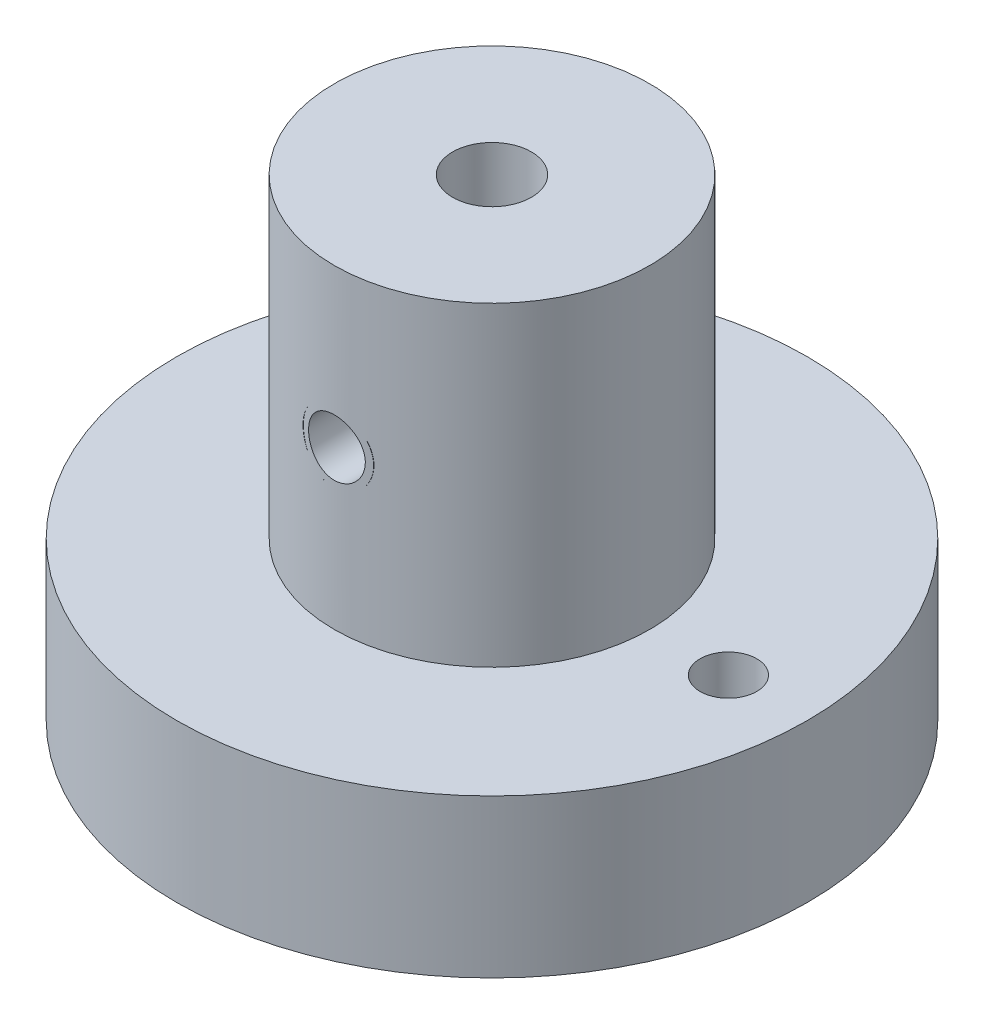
ISO-10303-21;
HEADER;
FILE_DESCRIPTION(('STEP AP214'),'2;1');
FILE_NAME('part.step','',(''),(''),'','','');
FILE_SCHEMA(('AUTOMOTIVE_DESIGN { 1 0 10303 214 1 1 1 1 }'));
ENDSEC;
DATA;
#1=APPLICATION_CONTEXT('core data for automotive mechanical design processes');
#2=APPLICATION_PROTOCOL_DEFINITION('international standard','automotive_design',2000,#1);
#3=PRODUCT_CONTEXT('',#1,'mechanical');
#4=PRODUCT('Part','Part','',(#3));
#5=PRODUCT_RELATED_PRODUCT_CATEGORY('part','',(#4));
#6=PRODUCT_DEFINITION_FORMATION('','',#4);
#7=PRODUCT_DEFINITION_CONTEXT('part definition',#1,'design');
#8=PRODUCT_DEFINITION('design','',#6,#7);
#9=PRODUCT_DEFINITION_SHAPE('','',#8);
#10=(LENGTH_UNIT() NAMED_UNIT(*) SI_UNIT(.MILLI.,.METRE.));
#11=(NAMED_UNIT(*) PLANE_ANGLE_UNIT() SI_UNIT($,.RADIAN.));
#12=(NAMED_UNIT(*) SI_UNIT($,.STERADIAN.) SOLID_ANGLE_UNIT());
#13=UNCERTAINTY_MEASURE_WITH_UNIT(LENGTH_MEASURE(1.E-05),#10,'distance_accuracy_value','');
#14=(GEOMETRIC_REPRESENTATION_CONTEXT(3) GLOBAL_UNCERTAINTY_ASSIGNED_CONTEXT((#13)) GLOBAL_UNIT_ASSIGNED_CONTEXT((#10,
#11,#12)) REPRESENTATION_CONTEXT('',''));
#15=CARTESIAN_POINT('',(0.,0.,0.));
#16=DIRECTION('',(0.,0.,1.));
#17=DIRECTION('',(1.,0.,0.));
#18=AXIS2_PLACEMENT_3D('',#15,#16,#17);
#19=CARTESIAN_POINT('',(9.525,-2.31775,0.));
#20=DIRECTION('',(0.,1.,0.));
#21=DIRECTION('',(0.,0.,1.));
#22=AXIS2_PLACEMENT_3D('',#19,#20,#21);
#23=CYLINDRICAL_SURFACE('',#22,1.4224);
#24=CARTESIAN_POINT('',(9.525,0.9144,0.));
#25=DIRECTION('',(0.,1.,0.));
#26=DIRECTION('',(0.,0.,1.));
#27=AXIS2_PLACEMENT_3D('',#24,#25,#26);
#28=CIRCLE('',#27,1.4224);
#29=CARTESIAN_POINT('',(9.525,0.9144,1.4224));
#30=VERTEX_POINT('',#29);
#31=EDGE_CURVE('P0_E11',#30,#30,#28,.T.);
#32=ORIENTED_EDGE('',*,*,#31,.T.);
#33=EDGE_LOOP('',(#32));
#34=FACE_BOUND('',#33,.T.);
#35=CARTESIAN_POINT('',(9.525,6.35,0.));
#36=DIRECTION('',(0.,1.,0.));
#37=DIRECTION('',(0.,0.,1.));
#38=AXIS2_PLACEMENT_3D('',#35,#36,#37);
#39=CIRCLE('',#38,1.4224);
#40=CARTESIAN_POINT('',(9.525,6.35,1.4224));
#41=VERTEX_POINT('',#40);
#42=EDGE_CURVE('P0_E24',#41,#41,#39,.F.);
#43=ORIENTED_EDGE('',*,*,#42,.T.);
#44=EDGE_LOOP('',(#43));
#45=FACE_BOUND('',#44,.T.);
#46=ADVANCED_FACE('P0_F17',(#34,#45),#23,.T.);
#47=CARTESIAN_POINT('',(9.525,0.9144,0.));
#48=DIRECTION('',(0.,1.,0.));
#49=DIRECTION('',(0.,0.,1.));
#50=AXIS2_PLACEMENT_3D('',#47,#48,#49);
#51=PLANE('',#50);
#52=CARTESIAN_POINT('',(10.668,0.9144,0.));
#53=CARTESIAN_POINT('',(10.667797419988,0.9144,0.218264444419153));
#54=CARTESIAN_POINT('',(10.5877480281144,0.9144,0.420732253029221));
#55=CARTESIAN_POINT('',(10.5009050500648,0.9144,0.640382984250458));
#56=CARTESIAN_POINT('',(10.3332230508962,0.9144,0.808223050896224));
#57=CARTESIAN_POINT('',(10.1662858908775,0.9144,0.975317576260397));
#58=CARTESIAN_POINT('',(9.94573225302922,0.9144,1.06274802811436));
#59=CARTESIAN_POINT('',(9.74354302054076,0.9144,1.14289858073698));
#60=CARTESIAN_POINT('',(9.525,0.9144,1.143));
#61=CARTESIAN_POINT('',(9.30750322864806,0.9144,1.14310093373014));
#62=CARTESIAN_POINT('',(9.10426774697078,0.9144,1.06274802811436));
#63=CARTESIAN_POINT('',(8.88461701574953,0.9144,0.975905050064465));
#64=CARTESIAN_POINT('',(8.71677694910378,0.9144,0.808223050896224));
#65=CARTESIAN_POINT('',(8.54968242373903,0.9144,0.641285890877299));
#66=CARTESIAN_POINT('',(8.46225197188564,0.9144,0.420732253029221));
#67=CARTESIAN_POINT('',(8.38220307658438,0.9144,0.218799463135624));
#68=CARTESIAN_POINT('',(8.382,0.9144,0.));
#69=B_SPLINE_CURVE_WITH_KNOTS('',2,(#52,#53,#54,#55,#56,#57,#58,#59,#60,#61,#62,#63,#64,#65,#66,
#67,#68),.UNSPECIFIED.,.F.,.F.,(3,2,2,2,2,2,2,2,3),(0.,0.125,0.25,0.375,0.5,0.625,0.75,0.875,
1.),.UNSPECIFIED.);
#70=CARTESIAN_POINT('',(10.668,0.9144,0.));
#71=VERTEX_POINT('',#70);
#72=CARTESIAN_POINT('',(8.382,0.9144,0.));
#73=VERTEX_POINT('',#72);
#74=EDGE_CURVE('P0_E28',#71,#73,#69,.T.);
#75=ORIENTED_EDGE('',*,*,#74,.F.);
#76=CARTESIAN_POINT('',(8.382,0.9144,0.));
#77=CARTESIAN_POINT('',(8.38220258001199,0.9144,-0.218264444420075));
#78=CARTESIAN_POINT('',(8.46225197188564,0.9144,-0.420732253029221));
#79=CARTESIAN_POINT('',(8.54909494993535,0.9144,-0.640382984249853));
#80=CARTESIAN_POINT('',(8.71677694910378,0.9144,-0.808223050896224));
#81=CARTESIAN_POINT('',(8.88371410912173,0.9144,-0.975317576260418));
#82=CARTESIAN_POINT('',(9.10426774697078,0.9144,-1.06274802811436));
#83=CARTESIAN_POINT('',(9.30645697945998,0.9144,-1.14289858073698));
#84=CARTESIAN_POINT('',(9.525,0.9144,-1.143));
#85=CARTESIAN_POINT('',(9.74249677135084,0.9144,-1.14310093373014));
#86=CARTESIAN_POINT('',(9.94573225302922,0.9144,-1.06274802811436));
#87=CARTESIAN_POINT('',(10.1653829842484,0.9144,-0.975905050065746));
#88=CARTESIAN_POINT('',(10.3332230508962,0.9144,-0.808223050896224));
#89=CARTESIAN_POINT('',(10.5003175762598,0.9144,-0.641285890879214));
#90=CARTESIAN_POINT('',(10.5877480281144,0.9144,-0.420732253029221));
#91=CARTESIAN_POINT('',(10.6677969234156,0.9144,-0.218799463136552));
#92=CARTESIAN_POINT('',(10.668,0.9144,0.));
#93=B_SPLINE_CURVE_WITH_KNOTS('',2,(#76,#77,#78,#79,#80,#81,#82,#83,#84,#85,#86,#87,#88,#89,#90,
#91,#92),.UNSPECIFIED.,.F.,.F.,(3,2,2,2,2,2,2,2,3),(0.,0.125,0.25,0.375,0.5,0.625,0.75,0.875,
1.),.UNSPECIFIED.);
#94=EDGE_CURVE('P0_E33',#73,#71,#93,.T.);
#95=ORIENTED_EDGE('',*,*,#94,.F.);
#96=EDGE_LOOP('',(#75,#95));
#97=FACE_BOUND('',#96,.T.);
#98=ORIENTED_EDGE('',*,*,#31,.F.);
#99=EDGE_LOOP('',(#98));
#100=FACE_BOUND('',#99,.T.);
#101=ADVANCED_FACE('P0_F18',(#97,#100),#51,.F.);
#102=OPEN_SHELL('',(#46,#101));
#103=SHELL_BASED_SURFACE_MODEL('P0_B1',(#102));
#104=CARTESIAN_POINT('',(0.,6.35,0.));
#105=DIRECTION('',(0.,-1.,0.));
#106=DIRECTION('',(0.,0.,-1.));
#107=AXIS2_PLACEMENT_3D('',#104,#105,#106);
#108=PLANE('',#107);
#109=CARTESIAN_POINT('',(0.,6.35,0.));
#110=DIRECTION('',(0.,-1.,0.));
#111=DIRECTION('',(0.,0.,-1.));
#112=AXIS2_PLACEMENT_3D('',#109,#110,#111);
#113=CIRCLE('',#112,1.5875);
#114=CARTESIAN_POINT('',(0.,6.35,-1.5875));
#115=VERTEX_POINT('',#114);
#116=EDGE_CURVE('P1_E18',#115,#115,#113,.F.);
#117=ORIENTED_EDGE('',*,*,#116,.T.);
#118=EDGE_LOOP('',(#117));
#119=FACE_BOUND('',#118,.T.);
#120=ADVANCED_FACE('P1_F15',(#119),#108,.F.);
#121=CARTESIAN_POINT('',(0.,19.05,0.));
#122=DIRECTION('',(0.,-1.,0.));
#123=DIRECTION('',(0.,0.,-1.));
#124=AXIS2_PLACEMENT_3D('',#121,#122,#123);
#125=CYLINDRICAL_SURFACE('',#124,1.5875);
#126=ORIENTED_EDGE('',*,*,#116,.F.);
#127=EDGE_LOOP('',(#126));
#128=FACE_BOUND('',#127,.T.);
#129=CARTESIAN_POINT('',(-1.143,12.7,1.10168382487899));
#130=CARTESIAN_POINT('',(-1.14299365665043,12.6457509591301,1.1016961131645));
#131=CARTESIAN_POINT('',(-1.13909468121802,12.5914504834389,1.10577998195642));
#132=CARTESIAN_POINT('',(-1.12388244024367,12.4849283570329,1.12122686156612));
#133=CARTESIAN_POINT('',(-1.11254937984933,12.4327126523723,1.132609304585));
#134=CARTESIAN_POINT('',(-1.08349803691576,12.3323290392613,1.16042381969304));
#135=CARTESIAN_POINT('',(-1.06585880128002,12.284119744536,1.1767930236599));
#136=CARTESIAN_POINT('',(-1.02490051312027,12.1914769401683,1.21263169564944));
#137=CARTESIAN_POINT('',(-1.00158137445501,12.1470434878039,1.23210121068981));
#138=CARTESIAN_POINT('',(-0.944842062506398,12.0540738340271,1.27630432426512));
#139=CARTESIAN_POINT('',(-0.91034707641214,12.006336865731,1.3013394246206));
#140=CARTESIAN_POINT('',(-0.83438946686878,11.9166084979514,1.35130442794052));
#141=CARTESIAN_POINT('',(-0.792917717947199,11.8746247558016,1.37623414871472));
#142=CARTESIAN_POINT('',(-0.695186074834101,11.7900200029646,1.4284505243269));
#143=CARTESIAN_POINT('',(-0.637608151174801,11.7486570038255,1.45534801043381));
#144=CARTESIAN_POINT('',(-0.514016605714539,11.6766135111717,1.5034330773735));
#145=CARTESIAN_POINT('',(-0.448021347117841,11.6459102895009,1.52463278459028));
#146=CARTESIAN_POINT('',(-0.329051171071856,11.6041180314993,1.55387014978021));
#147=CARTESIAN_POINT('',(-0.277650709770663,11.5899396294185,1.56393351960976));
#148=CARTESIAN_POINT('',(-0.172664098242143,11.5688525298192,1.57896984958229));
#149=CARTESIAN_POINT('',(-0.119079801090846,11.5619377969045,1.58394703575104));
#150=CARTESIAN_POINT('',(-0.0111216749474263,11.5557730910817,1.58838217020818));
#151=CARTESIAN_POINT('',(0.043253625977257,11.5565399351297,1.58782800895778));
#152=CARTESIAN_POINT('',(0.151016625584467,11.565729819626,1.58122296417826));
#153=CARTESIAN_POINT('',(0.204404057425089,11.57415489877,1.57517061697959));
#154=CARTESIAN_POINT('',(0.307257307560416,11.5978413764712,1.55833054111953));
#155=CARTESIAN_POINT('',(0.356790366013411,11.6129100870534,1.54767644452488));
#156=CARTESIAN_POINT('',(0.45249336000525,11.6491339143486,1.52245137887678));
#157=CARTESIAN_POINT('',(0.498662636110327,11.6702902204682,1.50787964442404));
#158=CARTESIAN_POINT('',(0.591907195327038,11.7206092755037,1.47395028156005));
#159=CARTESIAN_POINT('',(0.63851304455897,11.7504004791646,1.45424076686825));
#160=CARTESIAN_POINT('',(0.726322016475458,11.8157453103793,1.41243854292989));
#161=CARTESIAN_POINT('',(0.76751964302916,11.8513047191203,1.39034345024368));
#162=CARTESIAN_POINT('',(0.851380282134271,11.9346747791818,1.34093019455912));
#163=CARTESIAN_POINT('',(0.892882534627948,11.9835333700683,1.31340668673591));
#164=CARTESIAN_POINT('',(0.96744042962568,12.0879356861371,1.25949507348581));
#165=CARTESIAN_POINT('',(1.00049507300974,12.1434802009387,1.2331071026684));
#166=CARTESIAN_POINT('',(1.05101247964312,12.2478958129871,1.19011560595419));
#167=CARTESIAN_POINT('',(1.07030723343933,12.2955175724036,1.17263972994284));
#168=CARTESIAN_POINT('',(1.10255418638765,12.3942223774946,1.14237608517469));
#169=CARTESIAN_POINT('',(1.11552494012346,12.4452947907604,1.12957462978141));
#170=CARTESIAN_POINT('',(1.1308831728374,12.5306444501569,1.11414997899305));
#171=CARTESIAN_POINT('',(1.1354089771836,12.5641812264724,1.10951463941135));
#172=CARTESIAN_POINT('',(1.14146925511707,12.6318052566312,1.10327783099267));
#173=CARTESIAN_POINT('',(1.14300398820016,12.6658924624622,1.10167609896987));
#174=CARTESIAN_POINT('',(1.14299365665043,12.7542490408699,1.1016961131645));
#175=CARTESIAN_POINT('',(1.13909468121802,12.8085495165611,1.10577998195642));
#176=CARTESIAN_POINT('',(1.12388244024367,12.9150716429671,1.12122686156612));
#177=CARTESIAN_POINT('',(1.11254937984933,12.9672873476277,1.132609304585));
#178=CARTESIAN_POINT('',(1.08349803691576,13.0676709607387,1.16042381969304));
#179=CARTESIAN_POINT('',(1.06585880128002,13.115880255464,1.1767930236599));
#180=CARTESIAN_POINT('',(1.02490051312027,13.2085230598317,1.21263169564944));
#181=CARTESIAN_POINT('',(1.00158137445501,13.2529565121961,1.23210121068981));
#182=CARTESIAN_POINT('',(0.944842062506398,13.3459261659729,1.27630432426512));
#183=CARTESIAN_POINT('',(0.91034707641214,13.393663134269,1.3013394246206));
#184=CARTESIAN_POINT('',(0.83438946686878,13.4833915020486,1.35130442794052));
#185=CARTESIAN_POINT('',(0.792917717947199,13.5253752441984,1.37623414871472));
#186=CARTESIAN_POINT('',(0.695186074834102,13.6099799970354,1.4284505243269));
#187=CARTESIAN_POINT('',(0.637608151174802,13.6513429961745,1.45534801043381));
#188=CARTESIAN_POINT('',(0.51401660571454,13.7233864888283,1.5034330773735));
#189=CARTESIAN_POINT('',(0.448021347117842,13.7540897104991,1.52463278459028));
#190=CARTESIAN_POINT('',(0.329051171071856,13.7958819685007,1.55387014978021));
#191=CARTESIAN_POINT('',(0.277650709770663,13.8100603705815,1.56393351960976));
#192=CARTESIAN_POINT('',(0.172664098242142,13.8311474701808,1.57896984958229));
#193=CARTESIAN_POINT('',(0.119079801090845,13.8380622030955,1.58394703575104));
#194=CARTESIAN_POINT('',(0.0111216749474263,13.8442269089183,1.58838217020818));
#195=CARTESIAN_POINT('',(-0.0432536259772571,13.8434600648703,1.58782800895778));
#196=CARTESIAN_POINT('',(-0.151016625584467,13.834270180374,1.58122296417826));
#197=CARTESIAN_POINT('',(-0.204404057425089,13.82584510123,1.57517061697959));
#198=CARTESIAN_POINT('',(-0.307257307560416,13.8021586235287,1.55833054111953));
#199=CARTESIAN_POINT('',(-0.356790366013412,13.7870899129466,1.54767644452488));
#200=CARTESIAN_POINT('',(-0.45249336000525,13.7508660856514,1.52245137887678));
#201=CARTESIAN_POINT('',(-0.498662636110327,13.7297097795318,1.50787964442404));
#202=CARTESIAN_POINT('',(-0.591907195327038,13.6793907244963,1.47395028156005));
#203=CARTESIAN_POINT('',(-0.63851304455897,13.6495995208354,1.45424076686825));
#204=CARTESIAN_POINT('',(-0.726322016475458,13.5842546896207,1.41243854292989));
#205=CARTESIAN_POINT('',(-0.76751964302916,13.5486952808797,1.39034345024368));
#206=CARTESIAN_POINT('',(-0.851380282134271,13.4653252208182,1.34093019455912));
#207=CARTESIAN_POINT('',(-0.892882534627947,13.4164666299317,1.31340668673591));
#208=CARTESIAN_POINT('',(-0.96744042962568,13.3120643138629,1.25949507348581));
#209=CARTESIAN_POINT('',(-1.00049507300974,13.2565197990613,1.2331071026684));
#210=CARTESIAN_POINT('',(-1.05101247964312,13.1521041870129,1.19011560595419));
#211=CARTESIAN_POINT('',(-1.07030723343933,13.1044824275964,1.17263972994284));
#212=CARTESIAN_POINT('',(-1.10255418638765,13.0057776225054,1.14237608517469));
#213=CARTESIAN_POINT('',(-1.11552494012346,12.9547052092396,1.12957462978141));
#214=CARTESIAN_POINT('',(-1.1308831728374,12.8693555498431,1.11414997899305));
#215=CARTESIAN_POINT('',(-1.1354089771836,12.8358187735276,1.10951463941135));
#216=CARTESIAN_POINT('',(-1.14146925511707,12.7681947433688,1.10327783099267));
#217=CARTESIAN_POINT('',(-1.14300398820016,12.7341075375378,1.10167609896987));
#218=CARTESIAN_POINT('',(-1.143,12.7,1.10168382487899));
#219=B_SPLINE_CURVE_WITH_KNOTS('',3,(#129,#130,#131,#132,#133,#134,#135,#136,#137,#138,#139,
#140,#141,#142,#143,#144,#145,#146,#147,#148,#149,#150,#151,#152,#153,#154,#155,#156,#157,#158,
#159,#160,#161,#162,#163,#164,#165,#166,#167,#168,#169,#170,#171,#172,#173,#174,#175,#176,#177,
#178,#179,#180,#181,#182,#183,#184,#185,#186,#187,#188,#189,#190,#191,#192,#193,#194,#195,#196,
#197,#198,#199,#200,#201,#202,#203,#204,#205,#206,#207,#208,#209,#210,#211,#212,#213,#214,#215,
#216,#217,#218),.UNSPECIFIED.,.T.,.F.,(4,2,2,2,2,2,2,2,2,2,2,2,2,2,2,2,2,2,2,2,2,2,2,2,2,2,2,2,
2,2,2,2,2,2,2,2,2,2,2,2,2,2,2,2,4),(0.,0.162577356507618,0.325589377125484,0.486625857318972,
0.647664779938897,0.83898022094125,1.03054787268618,1.2567619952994,1.48249079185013,
1.64458286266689,1.80654014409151,1.96885206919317,2.13120721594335,2.28913502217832,
2.44709370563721,2.62260521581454,2.79829373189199,3.00676216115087,3.21525523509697,
3.37753965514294,3.53934502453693,3.641569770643,3.74378564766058,3.9063630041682,
4.06937502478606,4.23041150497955,4.39145042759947,4.58276586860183,4.77433352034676,
5.00054764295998,5.22627643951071,5.38836851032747,5.55032579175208,5.71263771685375,
5.87499286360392,6.0329206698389,6.19087935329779,6.36639086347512,6.54207937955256,
6.75054780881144,6.95904088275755,7.12132530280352,7.28313067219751,7.38535541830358,
7.48757129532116),.UNSPECIFIED.);
#220=CARTESIAN_POINT('',(-1.143,12.7,1.10168382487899));
#221=VERTEX_POINT('',#220);
#222=EDGE_CURVE('P1_E132',#221,#221,#219,.T.);
#223=ORIENTED_EDGE('',*,*,#222,.T.);
#224=EDGE_LOOP('',(#223));
#225=FACE_BOUND('',#224,.T.);
#226=CARTESIAN_POINT('',(0.,19.05,0.));
#227=DIRECTION('',(0.,-1.,0.));
#228=DIRECTION('',(0.,0.,-1.));
#229=AXIS2_PLACEMENT_3D('',#226,#227,#228);
#230=CIRCLE('',#229,1.5875);
#231=CARTESIAN_POINT('',(0.,19.05,-1.5875));
#232=VERTEX_POINT('',#231);
#233=EDGE_CURVE('P1_E48',#232,#232,#230,.T.);
#234=ORIENTED_EDGE('',*,*,#233,.F.);
#235=EDGE_LOOP('',(#234));
#236=FACE_BOUND('',#235,.T.);
#237=ADVANCED_FACE('P1_F66',(#128,#225,#236),#125,.F.);
#238=CARTESIAN_POINT('',(0.,12.7,-1.49201287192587));
#239=DIRECTION('',(0.,0.,1.));
#240=DIRECTION('',(1.,0.,0.));
#241=AXIS2_PLACEMENT_3D('',#238,#239,#240);
#242=CYLINDRICAL_SURFACE('',#241,1.143);
#243=ORIENTED_EDGE('',*,*,#222,.F.);
#244=EDGE_LOOP('',(#243));
#245=FACE_BOUND('',#244,.T.);
#246=CARTESIAN_POINT('',(1.143,12.7,6.24628297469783));
#247=CARTESIAN_POINT('',(1.14299701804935,12.6364215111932,6.24628436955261));
#248=CARTESIAN_POINT('',(1.13767256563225,12.5727626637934,6.24726509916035));
#249=CARTESIAN_POINT('',(1.1165142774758,12.4471877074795,6.2510804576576));
#250=CARTESIAN_POINT('',(1.10065927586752,12.3852753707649,6.25391882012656));
#251=CARTESIAN_POINT('',(1.05893820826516,12.2651015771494,6.26111768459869));
#252=CARTESIAN_POINT('',(1.03308549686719,12.2068353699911,6.26547615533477));
#253=CARTESIAN_POINT('',(0.972133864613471,12.0954892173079,6.2752214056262));
#254=CARTESIAN_POINT('',(0.937038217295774,12.0424074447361,6.28060782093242));
#255=CARTESIAN_POINT('',(0.858159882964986,11.9422974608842,6.29187259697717));
#256=CARTESIAN_POINT('',(0.814290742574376,11.8953378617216,6.29775548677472));
#257=CARTESIAN_POINT('',(0.71929552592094,11.8094013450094,6.30931051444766));
#258=CARTESIAN_POINT('',(0.668168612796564,11.7704253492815,6.31498262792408));
#259=CARTESIAN_POINT('',(0.559668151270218,11.7013077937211,6.32552436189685));
#260=CARTESIAN_POINT('',(0.502253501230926,11.6712297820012,6.33038810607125));
#261=CARTESIAN_POINT('',(0.383084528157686,11.6211714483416,6.33871512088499));
#262=CARTESIAN_POINT('',(0.321330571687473,11.6011902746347,6.34217850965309));
#263=CARTESIAN_POINT('',(0.195938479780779,11.5721015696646,6.34728299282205));
#264=CARTESIAN_POINT('',(0.132327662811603,11.5628796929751,6.34894323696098));
#265=CARTESIAN_POINT('',(0.00444135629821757,11.555215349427,6.35032029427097));
#266=CARTESIAN_POINT('',(-0.05983408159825,11.5567720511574,6.35003725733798));
#267=CARTESIAN_POINT('',(-0.186441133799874,11.5705324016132,6.34757468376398));
#268=CARTESIAN_POINT('',(-0.248786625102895,11.5826128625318,6.34541709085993));
#269=CARTESIAN_POINT('',(-0.370551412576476,11.616883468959,6.33947236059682));
#270=CARTESIAN_POINT('',(-0.429970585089,11.639074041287,6.33568515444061));
#271=CARTESIAN_POINT('',(-0.544557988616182,11.6930550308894,6.32686965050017));
#272=CARTESIAN_POINT('',(-0.599702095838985,11.7248955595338,6.32183489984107));
#273=CARTESIAN_POINT('',(-0.703906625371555,11.7972332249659,6.31108258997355));
#274=CARTESIAN_POINT('',(-0.752966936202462,11.8377305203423,6.30536501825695));
#275=CARTESIAN_POINT('',(-0.84433668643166,11.9269047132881,6.29378660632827));
#276=CARTESIAN_POINT('',(-0.886542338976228,11.9756878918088,6.28792488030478));
#277=CARTESIAN_POINT('',(-0.962206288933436,12.0797212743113,6.27679272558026));
#278=CARTESIAN_POINT('',(-0.995660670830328,12.1349743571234,6.27152256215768));
#279=CARTESIAN_POINT('',(-1.05289624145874,12.250525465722,6.26216861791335));
#280=CARTESIAN_POINT('',(-1.0766553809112,12.3108346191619,6.25808754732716));
#281=CARTESIAN_POINT('',(-1.11362770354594,12.4345998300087,6.25161508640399));
#282=CARTESIAN_POINT('',(-1.12686314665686,12.4980489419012,6.24922013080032));
#283=CARTESIAN_POINT('',(-1.13743182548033,12.5849723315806,6.247299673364));
#284=CARTESIAN_POINT('',(-1.13951816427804,12.607923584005,6.24691927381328));
#285=CARTESIAN_POINT('',(-1.14230279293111,12.6539130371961,6.24641067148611));
#286=CARTESIAN_POINT('',(-1.14300108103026,12.6769512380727,6.24628246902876));
#287=CARTESIAN_POINT('',(-1.14299701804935,12.7635784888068,6.2462843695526));
#288=CARTESIAN_POINT('',(-1.13767256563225,12.8272373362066,6.24726509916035));
#289=CARTESIAN_POINT('',(-1.1165142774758,12.9528122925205,6.2510804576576));
#290=CARTESIAN_POINT('',(-1.10065927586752,13.0147246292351,6.25391882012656));
#291=CARTESIAN_POINT('',(-1.05893820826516,13.1348984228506,6.26111768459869));
#292=CARTESIAN_POINT('',(-1.03308549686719,13.1931646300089,6.26547615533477));
#293=CARTESIAN_POINT('',(-0.972133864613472,13.3045107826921,6.2752214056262));
#294=CARTESIAN_POINT('',(-0.937038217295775,13.3575925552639,6.28060782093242));
#295=CARTESIAN_POINT('',(-0.858159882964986,13.4577025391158,6.29187259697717));
#296=CARTESIAN_POINT('',(-0.814290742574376,13.5046621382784,6.29775548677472));
#297=CARTESIAN_POINT('',(-0.719295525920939,13.5905986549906,6.30931051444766));
#298=CARTESIAN_POINT('',(-0.668168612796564,13.6295746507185,6.31498262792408));
#299=CARTESIAN_POINT('',(-0.559668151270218,13.6986922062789,6.32552436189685));
#300=CARTESIAN_POINT('',(-0.502253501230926,13.7287702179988,6.33038810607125));
#301=CARTESIAN_POINT('',(-0.383084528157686,13.7788285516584,6.33871512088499));
#302=CARTESIAN_POINT('',(-0.321330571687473,13.7988097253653,6.34217850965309));
#303=CARTESIAN_POINT('',(-0.195938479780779,13.8278984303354,6.34728299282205));
#304=CARTESIAN_POINT('',(-0.132327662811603,13.8371203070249,6.34894323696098));
#305=CARTESIAN_POINT('',(-0.00444135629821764,13.844784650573,6.35032029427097));
#306=CARTESIAN_POINT('',(0.05983408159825,13.8432279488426,6.35003725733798));
#307=CARTESIAN_POINT('',(0.186441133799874,13.8294675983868,6.34757468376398));
#308=CARTESIAN_POINT('',(0.248786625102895,13.8173871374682,6.34541709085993));
#309=CARTESIAN_POINT('',(0.370551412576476,13.783116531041,6.33947236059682));
#310=CARTESIAN_POINT('',(0.429970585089,13.760925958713,6.33568515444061));
#311=CARTESIAN_POINT('',(0.544557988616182,13.7069449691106,6.32686965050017));
#312=CARTESIAN_POINT('',(0.599702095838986,13.6751044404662,6.32183489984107));
#313=CARTESIAN_POINT('',(0.703906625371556,13.6027667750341,6.31108258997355));
#314=CARTESIAN_POINT('',(0.752966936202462,13.5622694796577,6.30536501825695));
#315=CARTESIAN_POINT('',(0.84433668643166,13.4730952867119,6.29378660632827));
#316=CARTESIAN_POINT('',(0.886542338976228,13.4243121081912,6.28792488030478));
#317=CARTESIAN_POINT('',(0.962206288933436,13.3202787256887,6.27679272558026));
#318=CARTESIAN_POINT('',(0.995660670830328,13.2650256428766,6.27152256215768));
#319=CARTESIAN_POINT('',(1.05289624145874,13.149474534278,6.26216861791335));
#320=CARTESIAN_POINT('',(1.0766553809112,13.0891653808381,6.25808754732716));
#321=CARTESIAN_POINT('',(1.11362770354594,12.9654001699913,6.25161508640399));
#322=CARTESIAN_POINT('',(1.12686314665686,12.9019510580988,6.24922013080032));
#323=CARTESIAN_POINT('',(1.13743182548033,12.8150276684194,6.247299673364));
#324=CARTESIAN_POINT('',(1.13951816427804,12.792076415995,6.24691927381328));
#325=CARTESIAN_POINT('',(1.14230279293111,12.7460869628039,6.24641067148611));
#326=CARTESIAN_POINT('',(1.14300108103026,12.7230487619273,6.24628246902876));
#327=CARTESIAN_POINT('',(1.143,12.7,6.24628297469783));
#328=B_SPLINE_CURVE_WITH_KNOTS('',3,(#246,#247,#248,#249,#250,#251,#252,#253,#254,#255,#256,
#257,#258,#259,#260,#261,#262,#263,#264,#265,#266,#267,#268,#269,#270,#271,#272,#273,#274,#275,
#276,#277,#278,#279,#280,#281,#282,#283,#284,#285,#286,#287,#288,#289,#290,#291,#292,#293,#294,
#295,#296,#297,#298,#299,#300,#301,#302,#303,#304,#305,#306,#307,#308,#309,#310,#311,#312,#313,
#314,#315,#316,#317,#318,#319,#320,#321,#322,#323,#324,#325,#326,#327),.UNSPECIFIED.,.T.,.F.,(4,
2,2,2,2,2,2,2,2,2,2,2,2,2,2,2,2,2,2,2,2,2,2,2,2,2,2,2,2,2,2,2,2,2,2,2,2,2,2,2,4),(0.,
0.190647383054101,0.381679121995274,0.572456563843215,0.763166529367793,0.955857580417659,
1.14857086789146,1.34262898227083,1.53667072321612,1.72863092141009,1.92057631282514,
2.11030459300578,2.30004088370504,2.49077984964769,2.68152231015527,2.87492715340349,
3.06841838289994,3.26234723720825,3.45586478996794,3.52497905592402,3.59409340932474,
3.78474079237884,3.97577253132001,4.16654997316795,4.35725993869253,4.5499509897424,
4.74266427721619,4.93672239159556,5.13076413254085,5.32272433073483,5.51466972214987,
5.70439800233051,5.89413429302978,6.08487325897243,6.27561571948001,6.46902056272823,
6.66251179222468,6.85644064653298,7.04995819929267,7.11907246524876,7.18818681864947),.UNSPECIFIED.);
#329=CARTESIAN_POINT('',(1.143,12.7,6.24628297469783));
#330=VERTEX_POINT('',#329);
#331=EDGE_CURVE('P1_E41',#330,#330,#328,.T.);
#332=ORIENTED_EDGE('',*,*,#331,.F.);
#333=EDGE_LOOP('',(#332));
#334=FACE_BOUND('',#333,.T.);
#335=ADVANCED_FACE('P1_F49',(#245,#334),#242,.F.);
#336=CARTESIAN_POINT('',(0.,19.05,0.));
#337=DIRECTION('',(0.,1.,0.));
#338=DIRECTION('',(0.,0.,1.));
#339=AXIS2_PLACEMENT_3D('',#336,#337,#338);
#340=PLANE('',#339);
#341=ORIENTED_EDGE('',*,*,#233,.T.);
#342=EDGE_LOOP('',(#341));
#343=FACE_BOUND('',#342,.T.);
#344=CARTESIAN_POINT('',(0.,19.05,0.));
#345=DIRECTION('',(0.,1.,0.));
#346=DIRECTION('',(0.,0.,1.));
#347=AXIS2_PLACEMENT_3D('',#344,#345,#346);
#348=CIRCLE('',#347,6.35);
#349=CARTESIAN_POINT('',(0.,19.05,6.35));
#350=VERTEX_POINT('',#349);
#351=EDGE_CURVE('P1_E38',#350,#350,#348,.F.);
#352=ORIENTED_EDGE('',*,*,#351,.F.);
#353=EDGE_LOOP('',(#352));
#354=FACE_BOUND('',#353,.T.);
#355=ADVANCED_FACE('P1_F57',(#343,#354),#340,.T.);
#356=CARTESIAN_POINT('',(0.,6.35,0.));
#357=DIRECTION('',(0.,1.,0.));
#358=DIRECTION('',(0.,0.,1.));
#359=AXIS2_PLACEMENT_3D('',#356,#357,#358);
#360=CYLINDRICAL_SURFACE('',#359,6.35);
#361=ORIENTED_EDGE('',*,*,#351,.T.);
#362=EDGE_LOOP('',(#361));
#363=FACE_BOUND('',#362,.T.);
#364=CARTESIAN_POINT('',(0.,6.35,0.));
#365=DIRECTION('',(0.,1.,0.));
#366=DIRECTION('',(0.,0.,1.));
#367=AXIS2_PLACEMENT_3D('',#364,#365,#366);
#368=CIRCLE('',#367,6.35);
#369=CARTESIAN_POINT('',(0.,6.35,6.35));
#370=VERTEX_POINT('',#369);
#371=EDGE_CURVE('P1_E35',#370,#370,#368,.F.);
#372=ORIENTED_EDGE('',*,*,#371,.F.);
#373=EDGE_LOOP('',(#372));
#374=FACE_BOUND('',#373,.T.);
#375=ORIENTED_EDGE('',*,*,#331,.T.);
#376=EDGE_LOOP('',(#375));
#377=FACE_BOUND('',#376,.T.);
#378=ADVANCED_FACE('P1_F52',(#363,#374,#377),#360,.T.);
#379=CARTESIAN_POINT('',(0.,6.35,0.));
#380=DIRECTION('',(0.,1.,0.));
#381=DIRECTION('',(0.,0.,1.));
#382=AXIS2_PLACEMENT_3D('',#379,#380,#381);
#383=PLANE('',#382);
#384=CARTESIAN_POINT('',(9.525,6.35,0.));
#385=DIRECTION('',(0.,1.,0.));
#386=DIRECTION('',(0.,0.,1.));
#387=AXIS2_PLACEMENT_3D('',#384,#385,#386);
#388=CIRCLE('',#387,1.143);
#389=CARTESIAN_POINT('',(9.525,6.35,1.143));
#390=VERTEX_POINT('',#389);
#391=EDGE_CURVE('P1_E27',#390,#390,#388,.F.);
#392=ORIENTED_EDGE('',*,*,#391,.T.);
#393=EDGE_LOOP('',(#392));
#394=FACE_BOUND('',#393,.T.);
#395=ORIENTED_EDGE('',*,*,#371,.T.);
#396=EDGE_LOOP('',(#395));
#397=FACE_BOUND('',#396,.T.);
#398=CARTESIAN_POINT('',(0.,6.35,0.));
#399=DIRECTION('',(0.,1.,0.));
#400=DIRECTION('',(0.,0.,1.));
#401=AXIS2_PLACEMENT_3D('',#398,#399,#400);
#402=CIRCLE('',#401,12.7);
#403=CARTESIAN_POINT('',(0.,6.35,12.7));
#404=VERTEX_POINT('',#403);
#405=EDGE_CURVE('P1_E32',#404,#404,#402,.F.);
#406=ORIENTED_EDGE('',*,*,#405,.F.);
#407=EDGE_LOOP('',(#406));
#408=FACE_BOUND('',#407,.T.);
#409=ADVANCED_FACE('P1_F56',(#394,#397,#408),#383,.T.);
#410=CARTESIAN_POINT('',(0.,0.,0.));
#411=DIRECTION('',(0.,1.,0.));
#412=DIRECTION('',(0.,0.,1.));
#413=AXIS2_PLACEMENT_3D('',#410,#411,#412);
#414=CYLINDRICAL_SURFACE('',#413,12.7);
#415=ORIENTED_EDGE('',*,*,#405,.T.);
#416=EDGE_LOOP('',(#415));
#417=FACE_BOUND('',#416,.T.);
#418=CARTESIAN_POINT('',(0.,0.,0.));
#419=DIRECTION('',(0.,1.,0.));
#420=DIRECTION('',(0.,0.,1.));
#421=AXIS2_PLACEMENT_3D('',#418,#419,#420);
#422=CIRCLE('',#421,12.7);
#423=CARTESIAN_POINT('',(0.,0.,12.7));
#424=VERTEX_POINT('',#423);
#425=EDGE_CURVE('P1_E22',#424,#424,#422,.T.);
#426=ORIENTED_EDGE('',*,*,#425,.T.);
#427=EDGE_LOOP('',(#426));
#428=FACE_BOUND('',#427,.T.);
#429=ADVANCED_FACE('P1_F78',(#417,#428),#414,.T.);
#430=CARTESIAN_POINT('',(9.525,-2.31775,0.));
#431=DIRECTION('',(0.,1.,0.));
#432=DIRECTION('',(0.,0.,1.));
#433=AXIS2_PLACEMENT_3D('',#430,#431,#432);
#434=CYLINDRICAL_SURFACE('',#433,1.143);
#435=ORIENTED_EDGE('',*,*,#391,.F.);
#436=EDGE_LOOP('',(#435));
#437=FACE_BOUND('',#436,.T.);
#438=CARTESIAN_POINT('',(9.525,0.,0.));
#439=DIRECTION('',(0.,1.,0.));
#440=DIRECTION('',(0.,0.,1.));
#441=AXIS2_PLACEMENT_3D('',#438,#439,#440);
#442=CIRCLE('',#441,1.143);
#443=CARTESIAN_POINT('',(9.525,0.,1.143));
#444=VERTEX_POINT('',#443);
#445=EDGE_CURVE('P1_E10',#444,#444,#442,.F.);
#446=ORIENTED_EDGE('',*,*,#445,.T.);
#447=EDGE_LOOP('',(#446));
#448=FACE_BOUND('',#447,.T.);
#449=ADVANCED_FACE('P1_F72',(#437,#448),#434,.F.);
#450=CARTESIAN_POINT('',(0.,0.,0.));
#451=DIRECTION('',(0.,1.,0.));
#452=DIRECTION('',(0.,0.,1.));
#453=AXIS2_PLACEMENT_3D('',#450,#451,#452);
#454=PLANE('',#453);
#455=ORIENTED_EDGE('',*,*,#445,.F.);
#456=EDGE_LOOP('',(#455));
#457=FACE_BOUND('',#456,.T.);
#458=ORIENTED_EDGE('',*,*,#425,.F.);
#459=EDGE_LOOP('',(#458));
#460=FACE_BOUND('',#459,.T.);
#461=ADVANCED_FACE('P1_F70',(#457,#460),#454,.F.);
#462=CLOSED_SHELL('',(#120,#237,#335,#355,#378,#409,#429,#449,#461));
#463=MANIFOLD_SOLID_BREP('P1_B1',#462);
#464=CARTESIAN_POINT('',(0.,12.7,-1.49201287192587));
#465=DIRECTION('',(0.,0.,1.));
#466=DIRECTION('',(1.,0.,0.));
#467=AXIS2_PLACEMENT_3D('',#464,#465,#466);
#468=CYLINDRICAL_SURFACE('',#467,1.4224);
#469=CARTESIAN_POINT('',(-1.29770138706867,12.1175973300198,0.9144));
#470=CARTESIAN_POINT('',(-1.28798381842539,12.0959492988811,0.928238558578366));
#471=CARTESIAN_POINT('',(-1.27777170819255,12.0746410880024,0.942261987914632));
#472=CARTESIAN_POINT('',(-1.25384210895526,12.0277262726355,0.973932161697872));
#473=CARTESIAN_POINT('',(-1.23986751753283,12.0022981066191,0.991649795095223));
#474=CARTESIAN_POINT('',(-1.21676278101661,11.9631258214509,1.01967026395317));
#475=CARTESIAN_POINT('',(-1.20811948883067,11.9490394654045,1.02990066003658));
#476=CARTESIAN_POINT('',(-1.19005451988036,11.9207158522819,1.05072986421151));
#477=CARTESIAN_POINT('',(-1.18061639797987,11.9064896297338,1.06132941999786));
#478=CARTESIAN_POINT('',(-1.15524972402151,11.8697102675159,1.08902448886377));
#479=CARTESIAN_POINT('',(-1.13890460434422,11.8474263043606,1.1060992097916));
#480=CARTESIAN_POINT('',(-1.11028373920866,11.8107026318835,1.13473840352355));
#481=CARTESIAN_POINT('',(-1.09835826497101,11.7960133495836,1.14633569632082));
#482=CARTESIAN_POINT('',(-1.06775099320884,11.7598212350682,1.17507070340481));
#483=CARTESIAN_POINT('',(-1.04866170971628,11.7385676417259,1.19209184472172));
#484=CARTESIAN_POINT('',(-1.01020834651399,11.6982859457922,1.22471482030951));
#485=CARTESIAN_POINT('',(-0.99092541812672,11.679200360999,1.24034149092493));
#486=CARTESIAN_POINT('',(-0.952317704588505,11.6431336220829,1.27015585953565));
#487=CARTESIAN_POINT('',(-0.933069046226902,11.6260952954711,1.28437282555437));
#488=CARTESIAN_POINT('',(-0.894748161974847,11.5940023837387,1.31137011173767));
#489=CARTESIAN_POINT('',(-0.875746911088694,11.5788909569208,1.32418354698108));
#490=CARTESIAN_POINT('',(-0.838106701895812,11.5505153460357,1.34836072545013));
#491=CARTESIAN_POINT('',(-0.819534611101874,11.5371958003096,1.35976329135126));
#492=CARTESIAN_POINT('',(-0.788429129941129,11.5160171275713,1.37792934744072));
#493=CARTESIAN_POINT('',(-0.776153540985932,11.5079324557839,1.38487303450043));
#494=CARTESIAN_POINT('',(-0.75148449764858,11.4922323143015,1.39839574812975));
#495=CARTESIAN_POINT('',(-0.739097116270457,11.4846110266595,1.4049790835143));
#496=CARTESIAN_POINT('',(-0.714222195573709,11.4698317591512,1.41777604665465));
#497=CARTESIAN_POINT('',(-0.701740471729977,11.4626679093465,1.42399419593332));
#498=CARTESIAN_POINT('',(-0.676696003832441,11.4487983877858,1.43606194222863));
#499=CARTESIAN_POINT('',(-0.664138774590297,11.4420867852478,1.44191616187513));
#500=CARTESIAN_POINT('',(-0.638961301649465,11.4291156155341,1.45325559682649));
#501=CARTESIAN_POINT('',(-0.626346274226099,11.4228500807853,1.45874556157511));
#502=CARTESIAN_POINT('',(-0.601070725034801,11.4107644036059,1.46935642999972));
#503=CARTESIAN_POINT('',(-0.588415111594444,11.4049382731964,1.47448219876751));
#504=CARTESIAN_POINT('',(-0.563075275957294,11.3937241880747,1.48436462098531));
#505=CARTESIAN_POINT('',(-0.550395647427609,11.3883302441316,1.48912624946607));
#506=CARTESIAN_POINT('',(-0.525023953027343,11.3779727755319,1.4982799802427));
#507=CARTESIAN_POINT('',(-0.5123361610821,11.373003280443,1.50267716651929));
#508=CARTESIAN_POINT('',(-0.486964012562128,11.3634865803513,1.51110302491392));
#509=CARTESIAN_POINT('',(-0.474283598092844,11.3589334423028,1.51513685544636));
#510=CARTESIAN_POINT('',(-0.448940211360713,11.3502404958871,1.52283185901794));
#511=CARTESIAN_POINT('',(-0.436280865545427,11.3460948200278,1.52649834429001));
#512=CARTESIAN_POINT('',(-0.409664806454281,11.3377931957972,1.53384094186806));
#513=CARTESIAN_POINT('',(-0.395691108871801,11.333667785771,1.53749009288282));
#514=CARTESIAN_POINT('',(-0.367685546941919,11.3258681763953,1.54440576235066));
#515=CARTESIAN_POINT('',(-0.353655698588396,11.3221898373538,1.54767577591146));
#516=CARTESIAN_POINT('',(-0.32555162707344,11.315281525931,1.55382899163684));
#517=CARTESIAN_POINT('',(-0.311479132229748,11.312047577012,1.5567156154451));
#518=CARTESIAN_POINT('',(-0.283304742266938,11.3060251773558,1.5621033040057));
#519=CARTESIAN_POINT('',(-0.269204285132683,11.3032329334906,1.56460764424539));
#520=CARTESIAN_POINT('',(-0.240988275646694,11.2980904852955,1.56923060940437));
#521=CARTESIAN_POINT('',(-0.226873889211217,11.2957366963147,1.57135235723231));
#522=CARTESIAN_POINT('',(-0.198644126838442,11.2914672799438,1.57521037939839));
#523=CARTESIAN_POINT('',(-0.184529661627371,11.289548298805,1.57694960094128));
#524=CARTESIAN_POINT('',(-0.156313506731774,11.2861441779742,1.58004272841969));
#525=CARTESIAN_POINT('',(-0.14221249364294,11.2846559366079,1.58139938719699));
#526=CARTESIAN_POINT('',(-0.1140366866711,11.2821085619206,1.58372760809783));
#527=CARTESIAN_POINT('',(-0.0999623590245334,11.2810465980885,1.58470170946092));
#528=CARTESIAN_POINT('',(-0.0718530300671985,11.2793466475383,1.58626498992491));
#529=CARTESIAN_POINT('',(-0.0578183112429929,11.2787061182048,1.58685647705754));
#530=CARTESIAN_POINT('',(-0.0298009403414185,11.2778435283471,1.58765493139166));
#531=CARTESIAN_POINT('',(-0.0158184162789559,11.2776192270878,1.58786395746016));
#532=CARTESIAN_POINT('',(0.0121397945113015,11.2775831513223,1.5878972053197));
#533=CARTESIAN_POINT('',(0.026115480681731,11.2777711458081,1.58772164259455));
#534=CARTESIAN_POINT('',(0.054122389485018,11.2785606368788,1.58698956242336));
#535=CARTESIAN_POINT('',(0.0681534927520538,11.27916441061,1.58643094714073));
#536=CARTESIAN_POINT('',(0.0962588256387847,11.2807905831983,1.58493318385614));
#537=CARTESIAN_POINT('',(0.110332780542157,11.2818155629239,1.58399169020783));
#538=CARTESIAN_POINT('',(0.138511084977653,11.2842889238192,1.58172837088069));
#539=CARTESIAN_POINT('',(0.152614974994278,11.2857401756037,1.58040396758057));
#540=CARTESIAN_POINT('',(0.180840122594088,11.2890704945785,1.57737506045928));
#541=CARTESIAN_POINT('',(0.194960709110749,11.2909527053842,1.57566776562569));
#542=CARTESIAN_POINT('',(0.223205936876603,11.295148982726,1.57187330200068));
#543=CARTESIAN_POINT('',(0.237329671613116,11.297466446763,1.56978314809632));
#544=CARTESIAN_POINT('',(0.265567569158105,11.3025368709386,1.56522306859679));
#545=CARTESIAN_POINT('',(0.279680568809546,11.3052934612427,1.56274998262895));
#546=CARTESIAN_POINT('',(0.307883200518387,11.311245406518,1.55742453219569));
#547=CARTESIAN_POINT('',(0.321971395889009,11.3144446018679,1.55456885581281));
#548=CARTESIAN_POINT('',(0.350109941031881,11.3212844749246,1.54847713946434));
#549=CARTESIAN_POINT('',(0.364158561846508,11.3249291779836,1.54523764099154));
#550=CARTESIAN_POINT('',(0.392204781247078,11.3326628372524,1.53838307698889));
#551=CARTESIAN_POINT('',(0.406200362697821,11.3367559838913,1.53476448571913));
#552=CARTESIAN_POINT('',(0.432834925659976,11.3449893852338,1.52748565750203));
#553=CARTESIAN_POINT('',(0.445491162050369,11.3490983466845,1.52385308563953));
#554=CARTESIAN_POINT('',(0.4708324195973,11.3577179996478,1.51622403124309));
#555=CARTESIAN_POINT('',(0.483513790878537,11.3622346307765,1.51222213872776));
#556=CARTESIAN_POINT('',(0.508892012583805,11.3716787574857,1.50385870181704));
#557=CARTESIAN_POINT('',(0.521584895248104,11.3766122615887,1.49949191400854));
#558=CARTESIAN_POINT('',(0.54697085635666,11.3868984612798,1.49039740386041));
#559=CARTESIAN_POINT('',(0.55965963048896,11.3922572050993,1.48566451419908));
#560=CARTESIAN_POINT('',(0.585021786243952,11.4034018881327,1.47583802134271));
#561=CARTESIAN_POINT('',(0.597690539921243,11.4091938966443,1.47073936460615));
#562=CARTESIAN_POINT('',(0.622996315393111,11.4212126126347,1.46018116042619));
#563=CARTESIAN_POINT('',(0.635628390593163,11.4274453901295,1.4547166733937));
#564=CARTESIAN_POINT('',(0.660843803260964,11.4403526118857,1.44342662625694));
#565=CARTESIAN_POINT('',(0.673421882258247,11.4470331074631,1.43759624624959));
#566=CARTESIAN_POINT('',(0.698511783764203,11.4608422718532,1.42557463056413));
#567=CARTESIAN_POINT('',(0.711018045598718,11.4679769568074,1.41937870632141));
#568=CARTESIAN_POINT('',(0.735945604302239,11.4827000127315,1.40662454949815));
#569=CARTESIAN_POINT('',(0.748361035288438,11.4902943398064,1.40006173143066));
#570=CARTESIAN_POINT('',(0.773089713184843,11.5059430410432,1.38657875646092));
#571=CARTESIAN_POINT('',(0.785396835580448,11.5140033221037,1.37965423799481));
#572=CARTESIAN_POINT('',(0.816641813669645,11.535160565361,1.36150137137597));
#573=CARTESIAN_POINT('',(0.835319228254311,11.5484863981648,1.35008972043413));
#574=CARTESIAN_POINT('',(0.873171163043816,11.5768816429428,1.32588569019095));
#575=CARTESIAN_POINT('',(0.892278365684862,11.5920069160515,1.31305388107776));
#576=CARTESIAN_POINT('',(0.930811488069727,11.6241356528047,1.28601161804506));
#577=CARTESIAN_POINT('',(0.950165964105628,11.6411964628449,1.27176755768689));
#578=CARTESIAN_POINT('',(0.988984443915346,11.677317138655,1.2418906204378));
#579=CARTESIAN_POINT('',(1.00837181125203,11.6964346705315,1.22622804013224));
#580=CARTESIAN_POINT('',(1.04703172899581,11.7367897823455,1.19352451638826));
#581=CARTESIAN_POINT('',(1.06622257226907,11.758085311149,1.17645833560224));
#582=CARTESIAN_POINT('',(1.09711096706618,11.7944947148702,1.14753266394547));
#583=CARTESIAN_POINT('',(1.10921212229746,11.8093610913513,1.13578914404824));
#584=CARTESIAN_POINT('',(1.13808890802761,11.8463342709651,1.10694169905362));
#585=CARTESIAN_POINT('',(1.15451705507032,11.8686883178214,1.08980408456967));
#586=CARTESIAN_POINT('',(1.17997271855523,11.9055327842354,1.06204498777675));
#587=CARTESIAN_POINT('',(1.18942199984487,11.9197507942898,1.05144535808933));
#588=CARTESIAN_POINT('',(1.2075707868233,11.9481549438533,1.0305443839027));
#589=CARTESIAN_POINT('',(1.21628340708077,11.9623322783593,1.02024245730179));
#590=CARTESIAN_POINT('',(1.23955584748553,12.0017373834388,0.992042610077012));
#591=CARTESIAN_POINT('',(1.25362346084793,12.0273110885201,0.974217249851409));
#592=CARTESIAN_POINT('',(1.27768614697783,12.0744626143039,0.942380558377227));
#593=CARTESIAN_POINT('',(1.28794314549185,12.0958587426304,0.928297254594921));
#594=CARTESIAN_POINT('',(1.29770138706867,12.1175973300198,0.9144));
#595=B_SPLINE_CURVE_WITH_KNOTS('',3,(#469,#470,#471,#472,#473,#474,#475,#476,#477,#478,#479,
#480,#481,#482,#483,#484,#485,#486,#487,#488,#489,#490,#491,#492,#493,#494,#495,#496,#497,#498,
#499,#500,#501,#502,#503,#504,#505,#506,#507,#508,#509,#510,#511,#512,#513,#514,#515,#516,#517,
#518,#519,#520,#521,#522,#523,#524,#525,#526,#527,#528,#529,#530,#531,#532,#533,#534,#535,#536,
#537,#538,#539,#540,#541,#542,#543,#544,#545,#546,#547,#548,#549,#550,#551,#552,#553,#554,#555,
#556,#557,#558,#559,#560,#561,#562,#563,#564,#565,#566,#567,#568,#569,#570,#571,#572,#573,#574,
#575,#576,#577,#578,#579,#580,#581,#582,#583,#584,#585,#586,#587,#588,#589,#590,#591,#592,#593,
#594),.UNSPECIFIED.,.F.,.F.,(4,2,2,2,2,2,2,2,2,2,2,2,2,2,2,2,2,2,2,2,2,2,2,2,2,2,2,2,2,2,2,2,2,
2,2,2,2,2,2,2,2,2,2,2,2,2,2,2,2,2,2,2,2,2,2,2,2,2,2,2,2,2,4),(0.,0.0824037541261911,
0.184341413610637,0.242644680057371,0.30292166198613,0.400331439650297,0.466897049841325,
0.566607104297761,0.660494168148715,0.74858311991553,0.830904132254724,0.907494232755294,
0.956255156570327,1.00414063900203,1.05116425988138,1.09734035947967,1.14268408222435,
1.18721142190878,1.23093926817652,1.27388545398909,1.31606880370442,1.35750918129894,
1.40255798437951,1.44715139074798,1.49131537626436,1.53507668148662,1.57846279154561,
1.62150191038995,1.66422292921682,1.70665538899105,1.74882943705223,1.79077577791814,
1.83269862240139,1.87485291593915,1.91726944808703,1.95997844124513,2.00300950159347,
2.046391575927,2.09015291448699,2.13432103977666,2.17892272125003,2.22398395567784,
2.26535593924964,2.30747911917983,2.35037354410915,2.39405820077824,2.43855106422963,
2.48386914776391,2.53002855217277,2.57704451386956,2.62493145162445,2.67370301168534,
2.75054458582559,2.83313391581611,2.92150900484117,3.01570082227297,3.11573490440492,
3.18316418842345,3.28094221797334,3.34121762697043,3.39992397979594,3.50247041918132,
3.58522010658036),.UNSPECIFIED.);
#596=CARTESIAN_POINT('',(-1.29770138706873,12.11759733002,0.9144));
#597=VERTEX_POINT('',#596);
#598=CARTESIAN_POINT('',(1.29770138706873,12.11759733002,0.9144));
#599=VERTEX_POINT('',#598);
#600=EDGE_CURVE('P2_E56',#597,#599,#595,.T.);
#601=ORIENTED_EDGE('',*,*,#600,.T.);
#602=CARTESIAN_POINT('',(0.,12.7,0.9144));
#603=DIRECTION('',(0.,0.,1.));
#604=DIRECTION('',(1.,0.,0.));
#605=AXIS2_PLACEMENT_3D('',#602,#603,#604);
#606=CIRCLE('',#605,1.4224);
#607=CARTESIAN_POINT('',(1.29770138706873,13.28240266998,0.9144));
#608=VERTEX_POINT('',#607);
#609=EDGE_CURVE('P2_E20',#599,#608,#606,.T.);
#610=ORIENTED_EDGE('',*,*,#609,.T.);
#611=CARTESIAN_POINT('',(1.29770138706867,13.2824026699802,0.9144));
#612=CARTESIAN_POINT('',(1.28794745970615,13.3041316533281,0.928290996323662));
#613=CARTESIAN_POINT('',(1.27769522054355,13.3255184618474,0.942367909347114));
#614=CARTESIAN_POINT('',(1.25364758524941,13.3726430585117,0.974185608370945));
#615=CARTESIAN_POINT('',(1.23959088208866,13.3981995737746,0.991998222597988));
#616=CARTESIAN_POINT('',(1.21633835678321,13.4375767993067,1.0201765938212));
#617=CARTESIAN_POINT('',(1.20763411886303,13.4517430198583,1.03046979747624));
#618=CARTESIAN_POINT('',(1.18949014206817,13.4801455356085,1.05136811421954));
#619=CARTESIAN_POINT('',(1.18003658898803,13.494372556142,1.06197384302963));
#620=CARTESIAN_POINT('',(1.15458469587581,13.5312173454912,1.08973206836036));
#621=CARTESIAN_POINT('',(1.13816550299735,13.5535632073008,1.1068629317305));
#622=CARTESIAN_POINT('',(1.109332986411,13.5904872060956,1.13567173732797));
#623=CARTESIAN_POINT('',(1.0972682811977,13.6053134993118,1.14738328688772));
#624=CARTESIAN_POINT('',(1.0663923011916,13.6417239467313,1.17630788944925));
#625=CARTESIAN_POINT('',(1.04717294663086,13.6630581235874,1.1934035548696));
#626=CARTESIAN_POINT('',(1.00845148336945,13.7034865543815,1.22616414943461));
#627=CARTESIAN_POINT('',(0.989031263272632,13.7226388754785,1.24185436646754));
#628=CARTESIAN_POINT('',(0.950143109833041,13.7588251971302,1.27178448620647));
#629=CARTESIAN_POINT('',(0.93075198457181,13.7759169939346,1.28605415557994));
#630=CARTESIAN_POINT('',(0.892142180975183,13.8081037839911,1.31314549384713));
#631=CARTESIAN_POINT('',(0.872995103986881,13.823256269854,1.32600083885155));
#632=CARTESIAN_POINT('',(0.83506071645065,13.8517020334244,1.35025012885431));
#633=CARTESIAN_POINT('',(0.816340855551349,13.8650513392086,1.3616835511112));
#634=CARTESIAN_POINT('',(0.785022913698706,13.8862446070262,1.37987008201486));
#635=CARTESIAN_POINT('',(0.772686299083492,13.8943184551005,1.3868073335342));
#636=CARTESIAN_POINT('',(0.747895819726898,13.9099937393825,1.40031454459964));
#637=CARTESIAN_POINT('',(0.735448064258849,13.91760106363,1.40688886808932));
#638=CARTESIAN_POINT('',(0.710453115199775,13.9323493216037,1.4196650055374));
#639=CARTESIAN_POINT('',(0.697911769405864,13.939496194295,1.42587140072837));
#640=CARTESIAN_POINT('',(0.6727489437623,13.9533287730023,1.43791287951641));
#641=CARTESIAN_POINT('',(0.660133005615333,13.9600204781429,1.4437526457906));
#642=CARTESIAN_POINT('',(0.634839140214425,13.9729489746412,1.45506040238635));
#643=CARTESIAN_POINT('',(0.622166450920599,13.979191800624,1.46053320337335));
#644=CARTESIAN_POINT('',(0.596776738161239,13.9912292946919,1.47110697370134));
#645=CARTESIAN_POINT('',(0.584064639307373,13.9970300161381,1.47621287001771));
#646=CARTESIAN_POINT('',(0.558613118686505,14.0081906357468,1.48605277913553));
#647=CARTESIAN_POINT('',(0.545878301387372,14.0135565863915,1.49079182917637));
#648=CARTESIAN_POINT('',(0.520397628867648,14.0238555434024,1.49989762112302));
#649=CARTESIAN_POINT('',(0.507656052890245,14.0287945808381,1.50426950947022));
#650=CARTESIAN_POINT('',(0.482177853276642,14.0382479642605,1.512642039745));
#651=CARTESIAN_POINT('',(0.469445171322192,14.0427683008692,1.51664790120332));
#652=CARTESIAN_POINT('',(0.443998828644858,14.0513933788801,1.52428405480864));
#653=CARTESIAN_POINT('',(0.43128878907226,14.0555040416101,1.52791972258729));
#654=CARTESIAN_POINT('',(0.404599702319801,14.063719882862,1.53518640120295));
#655=CARTESIAN_POINT('',(0.390604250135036,14.0677951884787,1.53879100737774));
#656=CARTESIAN_POINT('',(0.362556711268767,14.075494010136,1.54561732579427));
#657=CARTESIAN_POINT('',(0.3485066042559,14.0791216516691,1.54884251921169));
#658=CARTESIAN_POINT('',(0.320363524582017,14.085928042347,1.55490565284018));
#659=CARTESIAN_POINT('',(0.30627224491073,14.0891107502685,1.5577469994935));
#660=CARTESIAN_POINT('',(0.278061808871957,14.0950301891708,1.56304374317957));
#661=CARTESIAN_POINT('',(0.263944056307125,14.0977706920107,1.56550239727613));
#662=CARTESIAN_POINT('',(0.235694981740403,14.1028092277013,1.57003358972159));
#663=CARTESIAN_POINT('',(0.221564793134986,14.1051108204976,1.57210922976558));
#664=CARTESIAN_POINT('',(0.193304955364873,14.1092754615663,1.5758746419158));
#665=CARTESIAN_POINT('',(0.179176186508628,14.1111418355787,1.57756733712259));
#666=CARTESIAN_POINT('',(0.150932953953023,14.1144404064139,1.58056702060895));
#667=CARTESIAN_POINT('',(0.136819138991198,14.1158756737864,1.58187673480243));
#668=CARTESIAN_POINT('',(0.108619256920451,14.1183168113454,1.58411067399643));
#669=CARTESIAN_POINT('',(0.0945336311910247,14.1193254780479,1.58503740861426));
#670=CARTESIAN_POINT('',(0.0664032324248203,14.1209185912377,1.58650558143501));
#671=CARTESIAN_POINT('',(0.0523587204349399,14.1215055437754,1.58704929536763));
#672=CARTESIAN_POINT('',(0.0243232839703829,14.1222607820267,1.58775177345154));
#673=CARTESIAN_POINT('',(0.0103324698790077,14.1224312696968,1.58791256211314));
#674=CARTESIAN_POINT('',(-0.0176364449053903,14.122359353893,1.58784893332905));
#675=CARTESIAN_POINT('',(-0.0316145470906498,14.1221172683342,1.58762481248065));
#676=CARTESIAN_POINT('',(-0.0596251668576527,14.1212192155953,1.58679542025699));
#677=CARTESIAN_POINT('',(-0.0736575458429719,14.1205609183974,1.58618800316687));
#678=CARTESIAN_POINT('',(-0.101764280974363,14.1188253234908,1.58459238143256));
#679=CARTESIAN_POINT('',(-0.115838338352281,14.1177453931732,1.58360178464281));
#680=CARTESIAN_POINT('',(-0.14401566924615,14.1151617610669,1.58124001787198));
#681=CARTESIAN_POINT('',(-0.158118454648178,14.1136551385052,1.57986622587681));
#682=CARTESIAN_POINT('',(-0.186340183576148,14.1102137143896,1.57673829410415));
#683=CARTESIAN_POINT('',(-0.200458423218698,14.1082757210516,1.57498132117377));
#684=CARTESIAN_POINT('',(-0.228697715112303,14.1039675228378,1.57108725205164));
#685=CARTESIAN_POINT('',(-0.242817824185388,14.1015938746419,1.56894713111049));
#686=CARTESIAN_POINT('',(-0.271047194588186,14.096410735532,1.56428686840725));
#687=CARTESIAN_POINT('',(-0.285155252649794,14.0935975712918,1.56176352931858));
#688=CARTESIAN_POINT('',(-0.313346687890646,14.0875321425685,1.55633730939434));
#689=CARTESIAN_POINT('',(-0.327428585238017,14.084275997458,1.5534310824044));
#690=CARTESIAN_POINT('',(-0.355553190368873,14.0773219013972,1.54723804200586));
#691=CARTESIAN_POINT('',(-0.369594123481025,14.0736198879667,1.54394773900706));
#692=CARTESIAN_POINT('',(-0.397623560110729,14.0657713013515,1.5369911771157));
#693=CARTESIAN_POINT('',(-0.411609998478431,14.0616205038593,1.53332136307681));
#694=CARTESIAN_POINT('',(-0.438194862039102,14.0532865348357,1.52595360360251));
#695=CARTESIAN_POINT('',(-0.450811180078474,14.0491353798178,1.52228392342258));
#696=CARTESIAN_POINT('',(-0.476071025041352,14.0404327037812,1.51458275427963));
#697=CARTESIAN_POINT('',(-0.488710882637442,14.035875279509,1.51054590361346));
#698=CARTESIAN_POINT('',(-0.514004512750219,14.0263510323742,1.50211449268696));
#699=CARTESIAN_POINT('',(-0.526654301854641,14.0213782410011,1.49771473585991));
#700=CARTESIAN_POINT('',(-0.551952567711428,14.0110150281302,1.48855627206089));
#701=CARTESIAN_POINT('',(-0.564596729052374,14.0056186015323,1.48379244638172));
#702=CARTESIAN_POINT('',(-0.589868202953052,13.9944002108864,1.47390605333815));
#703=CARTESIAN_POINT('',(-0.602490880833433,13.9885722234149,1.46877848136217));
#704=CARTESIAN_POINT('',(-0.627703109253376,13.9764833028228,1.45816442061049));
#705=CARTESIAN_POINT('',(-0.64028771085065,13.9702163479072,1.45267304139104));
#706=CARTESIAN_POINT('',(-0.665406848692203,13.9572426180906,1.441331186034));
#707=CARTESIAN_POINT('',(-0.677936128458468,13.9505298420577,1.4354759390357));
#708=CARTESIAN_POINT('',(-0.702927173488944,13.936658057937,1.42340655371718));
#709=CARTESIAN_POINT('',(-0.71538338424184,13.9294930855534,1.41718777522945));
#710=CARTESIAN_POINT('',(-0.740209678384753,13.9147114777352,1.40438992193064));
#711=CARTESIAN_POINT('',(-0.752573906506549,13.9070889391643,1.39780631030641));
#712=CARTESIAN_POINT('',(-0.777199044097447,13.8913859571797,1.3842835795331));
#713=CARTESIAN_POINT('',(-0.789453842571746,13.8832996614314,1.377340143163));
#714=CARTESIAN_POINT('',(-0.820462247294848,13.8621482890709,1.35920188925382));
#715=CARTESIAN_POINT('',(-0.838960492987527,13.8488601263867,1.3478289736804));
#716=CARTESIAN_POINT('',(-0.876455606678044,13.8205533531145,1.32371517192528));
#717=CARTESIAN_POINT('',(-0.895385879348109,13.8054796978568,1.31093565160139));
#718=CARTESIAN_POINT('',(-0.933568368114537,13.773468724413,1.28401053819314));
#719=CARTESIAN_POINT('',(-0.952749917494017,13.7564748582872,1.26983202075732));
#720=CARTESIAN_POINT('',(-0.991227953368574,13.7205037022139,1.24009886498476));
#721=CARTESIAN_POINT('',(-1.0104486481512,13.7014695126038,1.22451512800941));
#722=CARTESIAN_POINT('',(-1.04878311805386,13.6612974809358,1.19198224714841));
#723=CARTESIAN_POINT('',(-1.0678161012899,13.6401024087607,1.17500841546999));
#724=CARTESIAN_POINT('',(-1.09837997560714,13.6039605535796,1.14631435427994));
#725=CARTESIAN_POINT('',(-1.11031364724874,13.5892603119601,1.13470914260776));
#726=CARTESIAN_POINT('',(-1.1389208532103,13.5525509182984,1.10608259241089));
#727=CARTESIAN_POINT('',(-1.15524605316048,13.5302937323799,1.08902845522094));
#728=CARTESIAN_POINT('',(-1.18057532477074,13.4935707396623,1.06137489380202));
#729=CARTESIAN_POINT('',(-1.18999540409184,13.4793736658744,1.05079636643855));
#730=CARTESIAN_POINT('',(-1.20805003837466,13.4510724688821,1.02998177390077));
#731=CARTESIAN_POINT('',(-1.21669972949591,13.4369785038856,1.01974502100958));
#732=CARTESIAN_POINT('',(-1.23982219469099,13.3977832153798,0.99170614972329));
#733=CARTESIAN_POINT('',(-1.25380748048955,13.3723391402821,0.973976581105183));
#734=CARTESIAN_POINT('',(-1.2777558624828,13.3253919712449,0.942283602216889));
#735=CARTESIAN_POINT('',(-1.28797628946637,13.3040674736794,0.928249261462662));
#736=CARTESIAN_POINT('',(-1.29770138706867,13.2824026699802,0.9144));
#737=B_SPLINE_CURVE_WITH_KNOTS('',3,(#611,#612,#613,#614,#615,#616,#617,#618,#619,#620,#621,
#622,#623,#624,#625,#626,#627,#628,#629,#630,#631,#632,#633,#634,#635,#636,#637,#638,#639,#640,
#641,#642,#643,#644,#645,#646,#647,#648,#649,#650,#651,#652,#653,#654,#655,#656,#657,#658,#659,
#660,#661,#662,#663,#664,#665,#666,#667,#668,#669,#670,#671,#672,#673,#674,#675,#676,#677,#678,
#679,#680,#681,#682,#683,#684,#685,#686,#687,#688,#689,#690,#691,#692,#693,#694,#695,#696,#697,
#698,#699,#700,#701,#702,#703,#704,#705,#706,#707,#708,#709,#710,#711,#712,#713,#714,#715,#716,
#717,#718,#719,#720,#721,#722,#723,#724,#725,#726,#727,#728,#729,#730,#731,#732,#733,#734,#735,
#736),.UNSPECIFIED.,.F.,.F.,(4,2,2,2,2,2,2,2,2,2,2,2,2,2,2,2,2,2,2,2,2,2,2,2,2,2,2,2,2,2,2,2,2,
2,2,2,2,2,2,2,2,2,2,2,2,2,2,2,2,2,2,2,2,2,2,2,2,2,2,2,2,2,4),(0.,0.0827129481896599,
0.18518754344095,0.24384479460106,0.304154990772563,0.401892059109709,0.469132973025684,
0.569335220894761,0.663692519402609,0.752230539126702,0.834980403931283,0.911980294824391,
0.960855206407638,1.00885022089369,1.05597915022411,1.1022565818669,1.14769792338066,
1.19231944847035,1.23613834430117,1.27917275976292,1.32144185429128,1.36296584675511,
1.40800207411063,1.45258609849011,1.49674402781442,1.54050273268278,1.58388982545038,
1.62693363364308,1.66966316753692,1.7121080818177,1.75429863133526,1.79626562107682,
1.83820028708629,1.88037181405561,1.92281097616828,1.96554796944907,2.00861236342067,
2.05203305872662,2.09583825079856,2.14005539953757,2.18471120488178,2.22983158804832,
2.27116129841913,2.31324182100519,2.35609289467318,2.39973321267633,2.44418047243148,
2.48945142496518,2.53556192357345,2.5825269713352,2.63036076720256,2.67907675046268,
2.75541734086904,2.83748144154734,2.92530566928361,3.01891985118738,3.11834857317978,
3.18496153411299,3.28225385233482,3.34241028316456,3.40074865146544,3.50275375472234,
3.585221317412),.UNSPECIFIED.);
#738=CARTESIAN_POINT('',(-1.29770138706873,13.28240266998,0.9144));
#739=VERTEX_POINT('',#738);
#740=EDGE_CURVE('P2_E94',#608,#739,#737,.T.);
#741=ORIENTED_EDGE('',*,*,#740,.T.);
#742=CARTESIAN_POINT('',(0.,12.7,0.9144));
#743=DIRECTION('',(0.,0.,1.));
#744=DIRECTION('',(1.,0.,0.));
#745=AXIS2_PLACEMENT_3D('',#742,#743,#744);
#746=CIRCLE('',#745,1.4224);
#747=EDGE_CURVE('P2_E25',#739,#597,#746,.T.);
#748=ORIENTED_EDGE('',*,*,#747,.T.);
#749=EDGE_LOOP('',(#601,#610,#741,#748));
#750=FACE_BOUND('',#749,.T.);
#751=CARTESIAN_POINT('',(0.,14.1224,6.35));
#752=CARTESIAN_POINT('',(0.0222472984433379,14.1224004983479,6.34999953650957));
#753=CARTESIAN_POINT('',(0.0444944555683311,14.1218780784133,6.34987506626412));
#754=CARTESIAN_POINT('',(0.0892553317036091,14.1197760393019,6.34938454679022));
#755=CARTESIAN_POINT('',(0.111768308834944,14.1181813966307,6.34901506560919));
#756=CARTESIAN_POINT('',(0.157007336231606,14.1138932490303,6.34803457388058));
#757=CARTESIAN_POINT('',(0.179731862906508,14.111184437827,6.34742020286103));
#758=CARTESIAN_POINT('',(0.225336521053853,14.104629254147,6.34594987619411));
#759=CARTESIAN_POINT('',(0.248214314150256,14.1007673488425,6.34509062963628));
#760=CARTESIAN_POINT('',(0.294063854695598,14.0918696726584,6.34313030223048));
#761=CARTESIAN_POINT('',(0.317032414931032,14.0868181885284,6.34202599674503));
#762=CARTESIAN_POINT('',(0.362997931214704,14.0755079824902,6.33957620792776));
#763=CARTESIAN_POINT('',(0.385990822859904,14.0692334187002,6.33822757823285));
#764=CARTESIAN_POINT('',(0.43193486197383,14.0554472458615,6.33528630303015));
#765=CARTESIAN_POINT('',(0.45488103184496,14.0479197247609,6.33369053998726));
#766=CARTESIAN_POINT('',(0.500659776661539,14.0316005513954,6.33026548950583));
#767=CARTESIAN_POINT('',(0.523486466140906,14.0227929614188,6.32843329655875));
#768=CARTESIAN_POINT('',(0.561699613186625,14.0069056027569,6.32512258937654));
#769=CARTESIAN_POINT('',(0.577217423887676,14.0001262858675,6.32370834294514));
#770=CARTESIAN_POINT('',(0.609640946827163,13.9852668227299,6.3206149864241));
#771=CARTESIAN_POINT('',(0.62651735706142,13.9771251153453,6.31892373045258));
#772=CARTESIAN_POINT('',(0.661544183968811,13.9593661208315,6.31528111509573));
#773=CARTESIAN_POINT('',(0.679659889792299,13.9496822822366,6.31332042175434));
#774=CARTESIAN_POINT('',(0.717026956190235,13.9286550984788,6.30913497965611));
#775=CARTESIAN_POINT('',(0.736237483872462,13.9172407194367,6.30690219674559));
#776=CARTESIAN_POINT('',(0.775627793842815,13.892562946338,6.30217197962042));
#777=CARTESIAN_POINT('',(0.795759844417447,13.8792246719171,6.29966776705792));
#778=CARTESIAN_POINT('',(0.836797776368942,13.8505061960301,6.29439320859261));
#779=CARTESIAN_POINT('',(0.857648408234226,13.835047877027,6.29161699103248));
#780=CARTESIAN_POINT('',(0.888794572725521,13.8106090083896,6.28732660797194));
#781=CARTESIAN_POINT('',(0.899410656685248,13.8020292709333,6.28583767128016));
#782=CARTESIAN_POINT('',(0.920738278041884,13.7842792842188,6.28279205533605));
#783=CARTESIAN_POINT('',(0.931441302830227,13.7750988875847,6.28123476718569));
#784=CARTESIAN_POINT('',(0.952907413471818,13.7561254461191,6.27805376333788));
#785=CARTESIAN_POINT('',(0.963661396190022,13.746322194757,6.27642952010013));
#786=CARTESIAN_POINT('',(0.985191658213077,13.7260819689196,6.27310952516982));
#787=CARTESIAN_POINT('',(0.99595822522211,13.7156347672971,6.27141312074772));
#788=CARTESIAN_POINT('',(1.01730127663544,13.6942590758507,6.26799626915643));
#789=CARTESIAN_POINT('',(1.02787310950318,13.683325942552,6.26627581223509));
#790=CARTESIAN_POINT('',(1.04833257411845,13.661476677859,6.26290992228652));
#791=CARTESIAN_POINT('',(1.05823127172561,13.6505710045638,6.26126384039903));
#792=CARTESIAN_POINT('',(1.07736779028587,13.628818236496,6.25804128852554));
#793=CARTESIAN_POINT('',(1.08661663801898,13.6179809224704,6.25646430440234));
#794=CARTESIAN_POINT('',(1.10447792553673,13.5964037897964,6.25338144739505));
#795=CARTESIAN_POINT('',(1.11310131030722,13.5856730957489,6.25187497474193));
#796=CARTESIAN_POINT('',(1.13761015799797,13.5542511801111,6.24754032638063));
#797=CARTESIAN_POINT('',(1.15309021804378,13.5332379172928,6.24473551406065));
#798=CARTESIAN_POINT('',(1.18177312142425,13.4919709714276,6.23941234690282));
#799=CARTESIAN_POINT('',(1.19505971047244,13.471776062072,6.23688814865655));
#800=CARTESIAN_POINT('',(1.21957176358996,13.4323667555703,6.23212655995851));
#801=CARTESIAN_POINT('',(1.23087709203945,13.4132028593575,6.22988236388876));
#802=CARTESIAN_POINT('',(1.25163895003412,13.3760432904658,6.22568283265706));
#803=CARTESIAN_POINT('',(1.26117077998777,13.3580905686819,6.22371933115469));
#804=CARTESIAN_POINT('',(1.27859168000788,13.3235089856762,6.22007976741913));
#805=CARTESIAN_POINT('',(1.28655078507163,13.3069164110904,6.21839412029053));
#806=CARTESIAN_POINT('',(1.30102184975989,13.2751828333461,6.21532133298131));
#807=CARTESIAN_POINT('',(1.30759801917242,13.2600722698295,6.21392143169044));
#808=CARTESIAN_POINT('',(1.32327277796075,13.2222719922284,6.21058826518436));
#809=CARTESIAN_POINT('',(1.33205661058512,13.1994447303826,6.2087237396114));
#810=CARTESIAN_POINT('',(1.34832441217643,13.1536789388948,6.20523795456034));
#811=CARTESIAN_POINT('',(1.35582497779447,13.130746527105,6.20361363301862));
#812=CARTESIAN_POINT('',(1.36955545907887,13.0848444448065,6.20061999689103));
#813=CARTESIAN_POINT('',(1.37580193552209,13.0618799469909,6.19924738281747));
#814=CARTESIAN_POINT('',(1.38705617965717,13.0159859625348,6.19675417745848));
#815=CARTESIAN_POINT('',(1.39208042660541,12.9930606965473,6.19563025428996));
#816=CARTESIAN_POINT('',(1.40092582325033,12.9473125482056,6.19363530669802));
#817=CARTESIAN_POINT('',(1.4047633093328,12.9244929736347,6.19276086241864));
#818=CARTESIAN_POINT('',(1.41127377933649,12.879019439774,6.19126475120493));
#819=CARTESIAN_POINT('',(1.41396290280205,12.8563679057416,6.19063958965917));
#820=CARTESIAN_POINT('',(1.41821767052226,12.8112892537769,6.18964213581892));
#821=CARTESIAN_POINT('',(1.41979920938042,12.7888637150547,6.18926627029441));
#822=CARTESIAN_POINT('',(1.42188282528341,12.7442916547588,6.18876762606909));
#823=CARTESIAN_POINT('',(1.42240049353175,12.7221459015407,6.18864119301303));
#824=CARTESIAN_POINT('',(1.4224,12.7,6.1886410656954));
#825=B_SPLINE_CURVE_WITH_KNOTS('',3,(#751,#752,#753,#754,#755,#756,#757,#758,#759,#760,#761,
#762,#763,#764,#765,#766,#767,#768,#769,#770,#771,#772,#773,#774,#775,#776,#777,#778,#779,#780,
#781,#782,#783,#784,#785,#786,#787,#788,#789,#790,#791,#792,#793,#794,#795,#796,#797,#798,#799,
#800,#801,#802,#803,#804,#805,#806,#807,#808,#809,#810,#811,#812,#813,#814,#815,#816,#817,#818,
#819,#820,#821,#822,#823,#824),.UNSPECIFIED.,.F.,.F.,(4,2,2,2,2,2,2,2,2,2,2,2,2,2,2,2,2,2,2,2,2,
2,2,2,2,2,2,2,2,2,2,2,2,2,2,2,4),(0.,0.0667352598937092,0.134425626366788,0.203078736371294,
0.272701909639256,0.343302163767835,0.414886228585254,0.487460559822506,0.561031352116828,
0.612000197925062,0.66842650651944,0.730312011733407,0.797657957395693,0.870465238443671,
0.948734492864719,0.989921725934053,1.03247503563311,1.07639448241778,1.12168012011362,
1.16758865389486,1.21204117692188,1.25503773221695,1.29657836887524,1.37528473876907,
1.44816971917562,1.51523380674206,1.57647774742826,1.63190263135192,1.68151004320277,
1.75506406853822,1.82757994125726,1.89906403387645,1.96952299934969,2.03896378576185,
2.1073936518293,2.17482018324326,2.24125130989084),.UNSPECIFIED.);
#826=CARTESIAN_POINT('',(0.,14.1224,6.35));
#827=VERTEX_POINT('',#826);
#828=CARTESIAN_POINT('',(1.4224,12.7,6.1886410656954));
#829=VERTEX_POINT('',#828);
#830=EDGE_CURVE('P2_E61',#827,#829,#825,.T.);
#831=ORIENTED_EDGE('',*,*,#830,.T.);
#832=CARTESIAN_POINT('',(1.4224,12.7,6.1886410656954));
#833=CARTESIAN_POINT('',(1.42240049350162,12.6778548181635,6.18864119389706));
#834=CARTESIAN_POINT('',(1.42188285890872,12.6557097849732,6.18876765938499));
#835=CARTESIAN_POINT('',(1.41979933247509,12.6111381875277,6.1892664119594));
#836=CARTESIAN_POINT('',(1.41821780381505,12.5887123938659,6.18964236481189));
#837=CARTESIAN_POINT('',(1.41396294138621,12.5436322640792,6.19064003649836));
#838=CARTESIAN_POINT('',(1.41127366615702,12.5209795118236,6.19126533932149));
#839=CARTESIAN_POINT('',(1.40476263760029,12.4755025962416,6.19276177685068));
#840=CARTESIAN_POINT('',(1.40092469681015,12.4526808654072,6.19363641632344));
#841=CARTESIAN_POINT('',(1.39207799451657,12.4069274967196,6.19563179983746));
#842=CARTESIAN_POINT('',(1.38705284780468,12.3839991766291,6.19675597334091));
#843=CARTESIAN_POINT('',(1.37579626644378,12.3380982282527,6.19924972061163));
#844=CARTESIAN_POINT('',(1.36954830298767,12.3151298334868,6.20062263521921));
#845=CARTESIAN_POINT('',(1.35581417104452,12.269219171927,6.20361693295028));
#846=CARTESIAN_POINT('',(1.34831139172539,12.2462820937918,6.20524162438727));
#847=CARTESIAN_POINT('',(1.33203834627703,12.2005062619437,6.20872813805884));
#848=CARTESIAN_POINT('',(1.32325143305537,12.1776736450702,6.2105930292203));
#849=CARTESIAN_POINT('',(1.30757471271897,12.1398734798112,6.21392618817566));
#850=CARTESIAN_POINT('',(1.30100011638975,12.1247681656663,6.21532559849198));
#851=CARTESIAN_POINT('',(1.28653160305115,12.0930430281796,6.2183976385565));
#852=CARTESIAN_POINT('',(1.2785734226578,12.0764536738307,6.22008305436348));
#853=CARTESIAN_POINT('',(1.26115359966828,12.0418765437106,6.22372235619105));
#854=CARTESIAN_POINT('',(1.25162185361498,12.0239250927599,6.22568583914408));
#855=CARTESIAN_POINT('',(1.23085917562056,11.9867661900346,6.22988555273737));
#856=CARTESIAN_POINT('',(1.2195528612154,11.9676017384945,6.23212995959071));
#857=CARTESIAN_POINT('',(1.19503759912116,11.928189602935,6.23689218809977));
#858=CARTESIAN_POINT('',(1.18174869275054,11.9079924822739,6.23941682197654));
#859=CARTESIAN_POINT('',(1.15305964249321,11.8667196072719,6.24474108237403));
#860=CARTESIAN_POINT('',(1.13757564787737,11.8457027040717,6.24754655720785));
#861=CARTESIAN_POINT('',(1.11306006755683,11.8142750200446,6.25188227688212));
#862=CARTESIAN_POINT('',(1.10443401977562,11.8035420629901,6.25338916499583));
#863=CARTESIAN_POINT('',(1.0865669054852,11.7819601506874,6.25647290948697));
#864=CARTESIAN_POINT('',(1.07731487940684,11.7711203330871,6.25805036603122));
#865=CARTESIAN_POINT('',(1.05817146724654,11.7493623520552,6.26127391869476));
#866=CARTESIAN_POINT('',(1.04826903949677,11.7384539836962,6.26292052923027));
#867=CARTESIAN_POINT('',(1.02780154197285,11.7165991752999,6.26628753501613));
#868=CARTESIAN_POINT('',(1.01722539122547,11.7056632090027,6.26800857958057));
#869=CARTESIAN_POINT('',(0.995881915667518,11.6842905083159,6.27142524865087));
#870=CARTESIAN_POINT('',(0.985119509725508,11.6738488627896,6.27312088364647));
#871=CARTESIAN_POINT('',(0.963597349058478,11.6536189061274,6.27643942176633));
#872=CARTESIAN_POINT('',(0.952847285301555,11.6438203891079,6.27806297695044));
#873=CARTESIAN_POINT('',(0.931388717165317,11.6248556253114,6.28124268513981));
#874=CARTESIAN_POINT('',(0.920689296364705,11.6156791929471,6.28279936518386));
#875=CARTESIAN_POINT('',(0.899368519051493,11.5979363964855,6.28584384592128));
#876=CARTESIAN_POINT('',(0.888755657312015,11.5893599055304,6.28733225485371));
#877=CARTESIAN_POINT('',(0.857617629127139,11.5649290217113,6.29162130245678));
#878=CARTESIAN_POINT('',(0.836772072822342,11.5494752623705,6.29439670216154));
#879=CARTESIAN_POINT('',(0.795742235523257,11.5207635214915,6.29966995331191));
#880=CARTESIAN_POINT('',(0.775613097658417,11.5074275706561,6.30217366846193));
#881=CARTESIAN_POINT('',(0.736226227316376,11.4827524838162,6.30690321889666));
#882=CARTESIAN_POINT('',(0.717016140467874,11.471338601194,6.30913582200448));
#883=CARTESIAN_POINT('',(0.679647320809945,11.450310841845,6.31332124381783));
#884=CARTESIAN_POINT('',(0.66152935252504,11.440626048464,6.31528208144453));
#885=CARTESIAN_POINT('',(0.626495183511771,11.4228639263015,6.31892530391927));
#886=CARTESIAN_POINT('',(0.609613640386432,11.414720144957,6.32061700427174));
#887=CARTESIAN_POINT('',(0.577176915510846,11.3998556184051,6.32371165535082));
#888=CARTESIAN_POINT('',(0.561650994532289,11.3930733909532,6.32512671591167));
#889=CARTESIAN_POINT('',(0.523435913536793,11.377187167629,6.32843775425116));
#890=CARTESIAN_POINT('',(0.500615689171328,11.3683830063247,6.33026962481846));
#891=CARTESIAN_POINT('',(0.454848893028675,11.3520695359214,6.33369400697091));
#892=CARTESIAN_POINT('',(0.431908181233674,11.3445443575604,6.33528941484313));
#893=CARTESIAN_POINT('',(0.385973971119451,11.3307619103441,6.33823006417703));
#894=CARTESIAN_POINT('',(0.362985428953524,11.32448879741,6.33957841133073));
#895=CARTESIAN_POINT('',(0.317027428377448,11.3131807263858,6.34202769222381));
#896=CARTESIAN_POINT('',(0.294062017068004,11.3081299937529,6.34313176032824));
#897=CARTESIAN_POINT('',(0.248217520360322,11.299233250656,6.34509167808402));
#898=CARTESIAN_POINT('',(0.225341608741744,11.2953715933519,6.34595073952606));
#899=CARTESIAN_POINT('',(0.17973940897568,11.2888165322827,6.34742076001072));
#900=CARTESIAN_POINT('',(0.157015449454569,11.2861076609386,6.34803499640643));
#901=CARTESIAN_POINT('',(0.111776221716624,11.2818192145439,6.34901528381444));
#902=CARTESIAN_POINT('',(0.0892624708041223,11.2802243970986,6.34938468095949));
#903=CARTESIAN_POINT('',(0.0444987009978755,11.2781220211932,6.34987509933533));
#904=CARTESIAN_POINT('',(0.0222494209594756,11.2775995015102,6.34999953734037));
#905=CARTESIAN_POINT('',(0.,11.2776,6.35));
#906=B_SPLINE_CURVE_WITH_KNOTS('',3,(#832,#833,#834,#835,#836,#837,#838,#839,#840,#841,#842,
#843,#844,#845,#846,#847,#848,#849,#850,#851,#852,#853,#854,#855,#856,#857,#858,#859,#860,#861,
#862,#863,#864,#865,#866,#867,#868,#869,#870,#871,#872,#873,#874,#875,#876,#877,#878,#879,#880,
#881,#882,#883,#884,#885,#886,#887,#888,#889,#890,#891,#892,#893,#894,#895,#896,#897,#898,#899,
#900,#901,#902,#903,#904,#905),.UNSPECIFIED.,.F.,.F.,(4,2,2,2,2,2,2,2,2,2,2,2,2,2,2,2,2,2,2,2,2,
2,2,2,2,2,2,2,2,2,2,2,2,2,2,2,4),(0.,0.0664289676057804,0.133856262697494,0.202289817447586,
0.271737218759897,0.342205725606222,0.41370228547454,0.486233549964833,0.559805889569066,
0.609396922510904,0.664811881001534,0.726052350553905,0.793119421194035,0.866013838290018,
0.944736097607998,0.986287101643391,1.02929563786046,1.07376175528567,1.11968549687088,
1.16495045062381,1.20885153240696,1.25138879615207,1.29256230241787,1.37081106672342,
1.44360713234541,1.51095113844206,1.57284398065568,1.62928690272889,1.68028163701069,
1.75383065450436,1.82638722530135,1.89795754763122,1.96854807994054,2.03816555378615,
2.10681698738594,2.17450969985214,2.24125132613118),.UNSPECIFIED.);
#907=CARTESIAN_POINT('',(0.,11.2776,6.35));
#908=VERTEX_POINT('',#907);
#909=EDGE_CURVE('P2_E60',#829,#908,#906,.T.);
#910=ORIENTED_EDGE('',*,*,#909,.T.);
#911=CARTESIAN_POINT('',(0.,11.2776,6.35));
#912=CARTESIAN_POINT('',(-0.0222472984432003,11.2775995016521,6.34999953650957));
#913=CARTESIAN_POINT('',(-0.0444944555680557,11.2781219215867,6.34987506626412));
#914=CARTESIAN_POINT('',(-0.0892553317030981,11.2802239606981,6.34938454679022));
#915=CARTESIAN_POINT('',(-0.111768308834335,11.2818186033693,6.34901506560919));
#916=CARTESIAN_POINT('',(-0.157007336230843,11.2861067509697,6.34803457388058));
#917=CARTESIAN_POINT('',(-0.179731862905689,11.2888155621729,6.34742020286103));
#918=CARTESIAN_POINT('',(-0.22533652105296,11.2953707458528,6.3459498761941));
#919=CARTESIAN_POINT('',(-0.248214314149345,11.2992326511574,6.34509062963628));
#920=CARTESIAN_POINT('',(-0.294063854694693,11.3081303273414,6.34313030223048));
#921=CARTESIAN_POINT('',(-0.31703241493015,11.3131818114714,6.34202599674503));
#922=CARTESIAN_POINT('',(-0.362997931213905,11.3244920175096,6.33957620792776));
#923=CARTESIAN_POINT('',(-0.385990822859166,11.3307665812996,6.33822757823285));
#924=CARTESIAN_POINT('',(-0.431934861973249,11.3445527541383,6.33528630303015));
#925=CARTESIAN_POINT('',(-0.454881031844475,11.352080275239,6.33369053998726));
#926=CARTESIAN_POINT('',(-0.500659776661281,11.3683994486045,6.33026548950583));
#927=CARTESIAN_POINT('',(-0.52348646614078,11.3772070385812,6.32843329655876));
#928=CARTESIAN_POINT('',(-0.561699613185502,11.3930943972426,6.32512258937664));
#929=CARTESIAN_POINT('',(-0.577217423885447,11.3998737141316,6.32370834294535));
#930=CARTESIAN_POINT('',(-0.609640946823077,11.4147331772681,6.32061498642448));
#931=CARTESIAN_POINT('',(-0.62651735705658,11.4228748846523,6.31892373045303));
#932=CARTESIAN_POINT('',(-0.66154418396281,11.4406338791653,6.31528111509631));
#933=CARTESIAN_POINT('',(-0.679659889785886,11.4503177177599,6.31332042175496));
#934=CARTESIAN_POINT('',(-0.717026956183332,11.4713449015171,6.30913497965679));
#935=CARTESIAN_POINT('',(-0.736237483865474,11.482759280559,6.30690219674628));
#936=CARTESIAN_POINT('',(-0.775627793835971,11.5074370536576,6.30217197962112));
#937=CARTESIAN_POINT('',(-0.795759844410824,11.5207753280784,6.2996677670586));
#938=CARTESIAN_POINT('',(-0.836797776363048,11.5494938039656,6.29439320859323));
#939=CARTESIAN_POINT('',(-0.857648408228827,11.5649521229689,6.29161699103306));
#940=CARTESIAN_POINT('',(-0.888794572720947,11.5893909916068,6.28732660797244));
#941=CARTESIAN_POINT('',(-0.899410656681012,11.5979707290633,6.28583767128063));
#942=CARTESIAN_POINT('',(-0.920738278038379,11.6157207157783,6.28279205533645));
#943=CARTESIAN_POINT('',(-0.931441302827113,11.6249011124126,6.28123476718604));
#944=CARTESIAN_POINT('',(-0.952907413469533,11.6438745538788,6.27805376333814));
#945=CARTESIAN_POINT('',(-0.963661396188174,11.6536778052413,6.27642952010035));
#946=CARTESIAN_POINT('',(-0.985191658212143,11.6739180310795,6.27310952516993));
#947=CARTESIAN_POINT('',(-0.99595822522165,11.6843652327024,6.27141312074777));
#948=CARTESIAN_POINT('',(-1.01730127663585,11.7057409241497,6.2679962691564));
#949=CARTESIAN_POINT('',(-1.02787310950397,11.7166740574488,6.26627581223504));
#950=CARTESIAN_POINT('',(-1.04833257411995,11.7385233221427,6.2629099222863));
#951=CARTESIAN_POINT('',(-1.05823127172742,11.7494289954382,6.26126384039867));
#952=CARTESIAN_POINT('',(-1.07736779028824,11.7711817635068,6.25804128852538));
#953=CARTESIAN_POINT('',(-1.0866166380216,11.7820190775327,6.25646430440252));
#954=CARTESIAN_POINT('',(-1.10447792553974,11.8035962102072,6.25338144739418));
#955=CARTESIAN_POINT('',(-1.11310131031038,11.814326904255,6.25187497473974));
#956=CARTESIAN_POINT('',(-1.13761015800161,11.8457488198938,6.24754032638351));
#957=CARTESIAN_POINT('',(-1.1530902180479,11.8667620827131,6.24473551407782));
#958=CARTESIAN_POINT('',(-1.1817731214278,11.9080290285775,6.23941234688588));
#959=CARTESIAN_POINT('',(-1.19505971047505,11.9282239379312,6.23688814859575));
#960=CARTESIAN_POINT('',(-1.2195717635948,11.9676332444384,6.23212656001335));
#961=CARTESIAN_POINT('',(-1.23087709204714,11.9867971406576,6.22988236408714));
#962=CARTESIAN_POINT('',(-1.25163895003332,12.0239567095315,6.22568283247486));
#963=CARTESIAN_POINT('',(-1.26117077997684,12.0419094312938,6.22371933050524));
#964=CARTESIAN_POINT('',(-1.27859168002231,12.0764910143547,6.22007976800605));
#965=CARTESIAN_POINT('',(-1.28655078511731,12.0930835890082,6.21839412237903));
#966=CARTESIAN_POINT('',(-1.30102184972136,12.1248171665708,6.21532133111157));
#967=CARTESIAN_POINT('',(-1.30759801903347,12.1399277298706,6.21392142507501));
#968=CARTESIAN_POINT('',(-1.32327130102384,12.1777244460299,6.21058858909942));
#969=CARTESIAN_POINT('',(-1.33205383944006,12.2005480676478,6.20872437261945));
#970=CARTESIAN_POINT('',(-1.34831979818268,12.2463074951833,6.20523911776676));
#971=CARTESIAN_POINT('',(-1.35581975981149,12.2692372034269,6.2036150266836));
#972=CARTESIAN_POINT('',(-1.36954961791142,12.3151348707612,6.20062174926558));
#973=CARTESIAN_POINT('',(-1.37579602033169,12.3380976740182,6.19924927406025));
#974=CARTESIAN_POINT('',(-1.38705053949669,12.3839893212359,6.19675624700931));
#975=CARTESIAN_POINT('',(-1.39207508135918,12.4069139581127,6.19563237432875));
#976=CARTESIAN_POINT('',(-1.40092132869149,12.4526619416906,6.19363742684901));
#977=CARTESIAN_POINT('',(-1.40475931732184,12.4754819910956,6.19276294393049));
#978=CARTESIAN_POINT('',(-1.4112708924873,12.5209575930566,6.19126665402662));
#979=CARTESIAN_POINT('',(-1.41396056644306,12.5436107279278,6.1906413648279));
#980=CARTESIAN_POINT('',(-1.41821637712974,12.588693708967,6.18964355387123));
#981=CARTESIAN_POINT('',(-1.41979835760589,12.6111219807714,6.18926747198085));
#982=CARTESIAN_POINT('',(-1.4218826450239,12.6557006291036,6.18876829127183));
#983=CARTESIAN_POINT('',(-1.42240049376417,12.6778502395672,6.18864155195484));
#984=CARTESIAN_POINT('',(-1.4224,12.7,6.1886410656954));
#985=B_SPLINE_CURVE_WITH_KNOTS('',3,(#911,#912,#913,#914,#915,#916,#917,#918,#919,#920,#921,
#922,#923,#924,#925,#926,#927,#928,#929,#930,#931,#932,#933,#934,#935,#936,#937,#938,#939,#940,
#941,#942,#943,#944,#945,#946,#947,#948,#949,#950,#951,#952,#953,#954,#955,#956,#957,#958,#959,
#960,#961,#962,#963,#964,#965,#966,#967,#968,#969,#970,#971,#972,#973,#974,#975,#976,#977,#978,
#979,#980,#981,#982,#983,#984),.UNSPECIFIED.,.F.,.F.,(4,2,2,2,2,2,2,2,2,2,2,2,2,2,2,2,2,2,2,2,2,
2,2,2,2,2,2,2,2,2,2,2,2,2,2,2,4),(0.,0.0667352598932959,0.134425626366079,0.20307873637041,
0.272701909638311,0.34330216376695,0.414886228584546,0.487460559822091,0.561031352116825,
0.612000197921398,0.668426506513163,0.730312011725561,0.797657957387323,0.870465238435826,
0.948734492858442,0.989921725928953,1.03247503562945,1.07639448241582,1.12168012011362,
1.16758865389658,1.21204117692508,1.25503773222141,1.29657836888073,1.37528473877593,
1.44816971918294,1.51523380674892,1.57647774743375,1.63190263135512,1.68151004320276,
1.75505246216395,1.82756004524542,1.89903916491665,1.9694964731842,2.0389389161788,
2.10737374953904,2.1748085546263,2.24125125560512),.UNSPECIFIED.);
#986=CARTESIAN_POINT('',(-1.4224,12.7,6.1886410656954));
#987=VERTEX_POINT('',#986);
#988=EDGE_CURVE('P2_E32',#908,#987,#985,.T.);
#989=ORIENTED_EDGE('',*,*,#988,.T.);
#990=CARTESIAN_POINT('',(-1.4224,12.7,6.1886410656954));
#991=CARTESIAN_POINT('',(-1.42240049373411,12.7221490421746,6.18864155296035));
#992=CARTESIAN_POINT('',(-1.42188267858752,12.7442979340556,6.18876832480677));
#993=CARTESIAN_POINT('',(-1.41979848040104,12.7888761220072,6.18926761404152));
#994=CARTESIAN_POINT('',(-1.41821650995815,12.8113046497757,6.18964378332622));
#995=CARTESIAN_POINT('',(-1.41396060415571,12.8563891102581,6.19064181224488));
#996=CARTESIAN_POINT('',(-1.41127077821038,12.8790434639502,6.19126724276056));
#997=CARTESIAN_POINT('',(-1.40475864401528,12.9245224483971,6.1927638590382));
#998=CARTESIAN_POINT('',(-1.40092020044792,12.9473446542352,6.19363853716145));
#999=CARTESIAN_POINT('',(-1.39207264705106,12.9930978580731,6.19563392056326));
#1000=CARTESIAN_POINT('',(-1.38704720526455,13.0160255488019,6.19675804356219));
#1001=CARTESIAN_POINT('',(-1.37579034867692,13.0619241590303,6.19925161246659));
#1002=CARTESIAN_POINT('',(-1.36954245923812,13.0848908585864,6.20062438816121));
#1003=CARTESIAN_POINT('',(-1.35580895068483,13.1307971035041,6.20361832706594));
#1004=CARTESIAN_POINT('',(-1.34830677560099,13.153731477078,6.20524278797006));
#1005=CARTESIAN_POINT('',(-1.33203557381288,13.1995009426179,6.2087287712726));
#1006=CARTESIAN_POINT('',(-1.32324995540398,13.222329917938,6.21059335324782));
#1007=CARTESIAN_POINT('',(-1.30757471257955,13.2601265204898,6.21392618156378));
#1008=CARTESIAN_POINT('',(-1.30100011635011,13.2752318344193,6.21532559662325));
#1009=CARTESIAN_POINT('',(-1.28653160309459,13.3069569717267,6.21839764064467));
#1010=CARTESIAN_POINT('',(-1.27857342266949,13.323546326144,6.22008305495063));
#1011=CARTESIAN_POINT('',(-1.26115359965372,13.3581234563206,6.22372235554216));
#1012=CARTESIAN_POINT('',(-1.25162185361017,13.3760749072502,6.2256858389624));
#1013=CARTESIAN_POINT('',(-1.23085917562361,13.4132338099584,6.22988555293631));
#1014=CARTESIAN_POINT('',(-1.21955286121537,13.432398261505,6.23212995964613));
#1015=CARTESIAN_POINT('',(-1.19503759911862,13.4718103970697,6.23689218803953));
#1016=CARTESIAN_POINT('',(-1.18174869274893,13.4920075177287,6.23941682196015));
#1017=CARTESIAN_POINT('',(-1.15305964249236,13.533280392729,6.24474108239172));
#1018=CARTESIAN_POINT('',(-1.13757564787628,13.5542972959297,6.2475465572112));
#1019=CARTESIAN_POINT('',(-1.11306006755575,13.5857249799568,6.25188227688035));
#1020=CARTESIAN_POINT('',(-1.10443401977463,13.5964579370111,6.25338916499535));
#1021=CARTESIAN_POINT('',(-1.08656690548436,13.6180398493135,6.25647290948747));
#1022=CARTESIAN_POINT('',(-1.07731487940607,13.6288796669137,6.25805036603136));
#1023=CARTESIAN_POINT('',(-1.05817146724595,13.6506376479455,6.26127391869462));
#1024=CARTESIAN_POINT('',(-1.04826903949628,13.6615460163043,6.26292052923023));
#1025=CARTESIAN_POINT('',(-1.02780154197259,13.6834008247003,6.26628753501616));
#1026=CARTESIAN_POINT('',(-1.01722539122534,13.6943367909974,6.26800857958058));
#1027=CARTESIAN_POINT('',(-0.995881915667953,13.7157094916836,6.27142524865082));
#1028=CARTESIAN_POINT('',(-0.985119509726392,13.7261511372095,6.27312088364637));
#1029=CARTESIAN_POINT('',(-0.963597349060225,13.7463810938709,6.27643942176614));
#1030=CARTESIAN_POINT('',(-0.952847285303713,13.7561796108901,6.27806297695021));
#1031=CARTESIAN_POINT('',(-0.931388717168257,13.775144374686,6.2812426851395));
#1032=CARTESIAN_POINT('',(-0.920689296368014,13.7843208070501,6.28279936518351));
#1033=CARTESIAN_POINT('',(-0.899368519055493,13.8020636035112,6.28584384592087));
#1034=CARTESIAN_POINT('',(-0.888755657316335,13.8106400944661,6.28733225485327));
#1035=CARTESIAN_POINT('',(-0.857617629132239,13.8350709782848,6.29162130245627));
#1036=CARTESIAN_POINT('',(-0.836772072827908,13.8505247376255,6.29439670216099));
#1037=CARTESIAN_POINT('',(-0.795742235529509,13.8792364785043,6.29966995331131));
#1038=CARTESIAN_POINT('',(-0.775613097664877,13.8925724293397,6.30217366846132));
#1039=CARTESIAN_POINT('',(-0.736226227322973,13.9172475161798,6.30690321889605));
#1040=CARTESIAN_POINT('',(-0.717016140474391,13.9286613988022,6.30913582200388));
#1041=CARTESIAN_POINT('',(-0.679647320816,13.9496891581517,6.31332124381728));
#1042=CARTESIAN_POINT('',(-0.661529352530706,13.959373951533,6.31528208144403));
#1043=CARTESIAN_POINT('',(-0.626495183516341,13.9771360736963,6.31892530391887));
#1044=CARTESIAN_POINT('',(-0.609613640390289,13.9852798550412,6.3206170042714));
#1045=CARTESIAN_POINT('',(-0.57717691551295,14.0001443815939,6.32371165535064));
#1046=CARTESIAN_POINT('',(-0.561650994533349,14.0069266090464,6.32512671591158));
#1047=CARTESIAN_POINT('',(-0.523435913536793,14.022812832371,6.32843775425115));
#1048=CARTESIAN_POINT('',(-0.500615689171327,14.0316169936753,6.33026962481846));
#1049=CARTESIAN_POINT('',(-0.454848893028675,14.0479304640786,6.33369400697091));
#1050=CARTESIAN_POINT('',(-0.431908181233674,14.0554556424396,6.33528941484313));
#1051=CARTESIAN_POINT('',(-0.385973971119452,14.0692380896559,6.33823006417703));
#1052=CARTESIAN_POINT('',(-0.362985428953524,14.07551120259,6.33957841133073));
#1053=CARTESIAN_POINT('',(-0.317027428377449,14.0868192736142,6.34202769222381));
#1054=CARTESIAN_POINT('',(-0.294062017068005,14.0918700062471,6.34313176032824));
#1055=CARTESIAN_POINT('',(-0.248217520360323,14.100766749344,6.34509167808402));
#1056=CARTESIAN_POINT('',(-0.225341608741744,14.1046284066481,6.34595073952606));
#1057=CARTESIAN_POINT('',(-0.17973940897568,14.1111834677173,6.34742076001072));
#1058=CARTESIAN_POINT('',(-0.157015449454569,14.1138923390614,6.34803499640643));
#1059=CARTESIAN_POINT('',(-0.111776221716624,14.1181807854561,6.34901528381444));
#1060=CARTESIAN_POINT('',(-0.089262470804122,14.1197756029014,6.34938468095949));
#1061=CARTESIAN_POINT('',(-0.0444987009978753,14.1218779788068,6.34987509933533));
#1062=CARTESIAN_POINT('',(-0.0222494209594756,14.1224004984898,6.34999953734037));
#1063=CARTESIAN_POINT('',(0.,14.1224,6.35));
#1064=B_SPLINE_CURVE_WITH_KNOTS('',3,(#990,#991,#992,#993,#994,#995,#996,#997,#998,#999,#1000,
#1001,#1002,#1003,#1004,#1005,#1006,#1007,#1008,#1009,#1010,#1011,#1012,#1013,#1014,#1015,#1016,
#1017,#1018,#1019,#1020,#1021,#1022,#1023,#1024,#1025,#1026,#1027,#1028,#1029,#1030,#1031,#1032,
#1033,#1034,#1035,#1036,#1037,#1038,#1039,#1040,#1041,#1042,#1043,#1044,#1045,#1046,#1047,#1048,
#1049,#1050,#1051,#1052,#1053,#1054,#1055,#1056,#1057,#1058,#1059,#1060,#1061,#1062,#1063),
.UNSPECIFIED.,.F.,.F.,(4,2,2,2,2,2,2,2,2,2,2,2,2,2,2,2,2,2,2,2,2,2,2,2,2,2,2,2,2,2,2,2,2,2,2,2,
4),(0.,0.0664405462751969,0.133876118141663,0.202314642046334,0.271763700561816,
0.342230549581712,0.413722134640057,0.486245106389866,0.559805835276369,0.609396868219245,
0.664811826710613,0.726052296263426,0.793119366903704,0.866013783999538,0.944736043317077,
0.986287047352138,1.0292955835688,1.07376170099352,1.11968544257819,1.16495039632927,
1.20885147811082,1.25138874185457,1.29256224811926,1.37081101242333,1.44360707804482,
1.51095108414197,1.57284392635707,1.62928684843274,1.680281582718,1.75383060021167,
1.82638717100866,1.89795749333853,1.96854802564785,2.03816549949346,2.10681693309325,
2.17450964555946,2.24125127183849),.UNSPECIFIED.);
#1065=EDGE_CURVE('P2_E11',#987,#827,#1064,.T.);
#1066=ORIENTED_EDGE('',*,*,#1065,.T.);
#1067=EDGE_LOOP('',(#831,#910,#989,#1066));
#1068=FACE_BOUND('',#1067,.T.);
#1069=ADVANCED_FACE('P2_F17',(#750,#1068),#468,.T.);
#1070=CARTESIAN_POINT('',(0.,12.7,0.9144));
#1071=DIRECTION('',(0.,0.,1.));
#1072=DIRECTION('',(1.,0.,0.));
#1073=AXIS2_PLACEMENT_3D('',#1070,#1071,#1072);
#1074=PLANE('',#1073);
#1075=DIRECTION('',(0.,1.,0.));
#1076=VECTOR('',#1075,1.);
#1077=CARTESIAN_POINT('',(-1.29770138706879,12.7,0.9144));
#1078=LINE('',#1077,#1076);
#1079=EDGE_CURVE('P2_E57',#597,#739,#1078,.T.);
#1080=ORIENTED_EDGE('',*,*,#1079,.F.);
#1081=ORIENTED_EDGE('',*,*,#747,.F.);
#1082=EDGE_LOOP('',(#1080,#1081));
#1083=FACE_BOUND('',#1082,.T.);
#1084=ADVANCED_FACE('P2_F84',(#1083),#1074,.F.);
#1085=CARTESIAN_POINT('',(0.,12.7,0.9144));
#1086=DIRECTION('',(0.,0.,1.));
#1087=DIRECTION('',(1.,0.,0.));
#1088=AXIS2_PLACEMENT_3D('',#1085,#1086,#1087);
#1089=PLANE('',#1088);
#1090=ORIENTED_EDGE('',*,*,#609,.F.);
#1091=DIRECTION('',(0.,1.,0.));
#1092=VECTOR('',#1091,1.);
#1093=CARTESIAN_POINT('',(1.29770138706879,12.7,0.9144));
#1094=LINE('',#1093,#1092);
#1095=EDGE_CURVE('P2_E117',#608,#599,#1094,.F.);
#1096=ORIENTED_EDGE('',*,*,#1095,.F.);
#1097=EDGE_LOOP('',(#1090,#1096));
#1098=FACE_BOUND('',#1097,.T.);
#1099=ADVANCED_FACE('P2_F18',(#1098),#1089,.F.);
#1100=OPEN_SHELL('',(#1069,#1084,#1099));
#1101=SHELL_BASED_SURFACE_MODEL('P2_B1',(#1100));
#1102=ADVANCED_BREP_SHAPE_REPRESENTATION('',(#18,#463),#14);
#1103=MANIFOLD_SURFACE_SHAPE_REPRESENTATION('',(#18,#103,#1101),#14);
#1104=SHAPE_REPRESENTATION('',(#18),#14);
#1105=SHAPE_DEFINITION_REPRESENTATION(#9,#1104);
#1106=SHAPE_REPRESENTATION_RELATIONSHIP('','',#1104,#1102);
#1107=SHAPE_REPRESENTATION_RELATIONSHIP('','',#1104,#1103);
ENDSEC;
END-ISO-10303-21;
